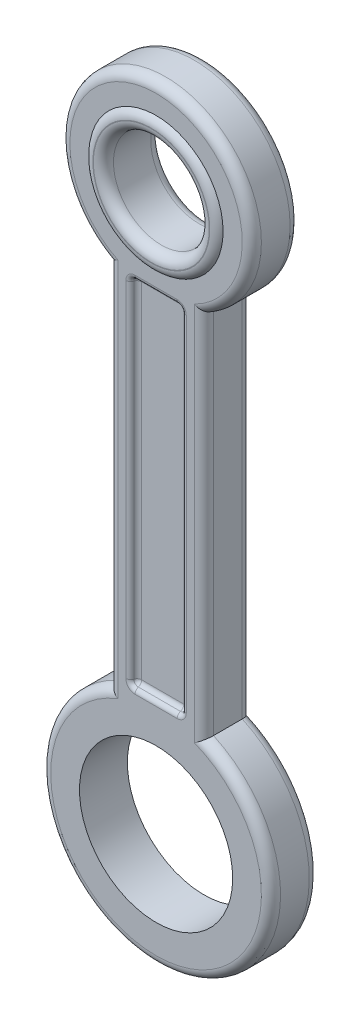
ISO-10303-21;
HEADER;
FILE_DESCRIPTION(('STEP AP214'),'2;1');
FILE_NAME('part.step','',(''),(''),'','','');
FILE_SCHEMA(('AUTOMOTIVE_DESIGN { 1 0 10303 214 1 1 1 1 }'));
ENDSEC;
DATA;
#1=APPLICATION_CONTEXT('core data for automotive mechanical design processes');
#2=APPLICATION_PROTOCOL_DEFINITION('international standard','automotive_design',2000,#1);
#3=PRODUCT_CONTEXT('',#1,'mechanical');
#4=PRODUCT('Part','Part','',(#3));
#5=PRODUCT_RELATED_PRODUCT_CATEGORY('part','',(#4));
#6=PRODUCT_DEFINITION_FORMATION('','',#4);
#7=PRODUCT_DEFINITION_CONTEXT('part definition',#1,'design');
#8=PRODUCT_DEFINITION('design','',#6,#7);
#9=PRODUCT_DEFINITION_SHAPE('','',#8);
#10=(LENGTH_UNIT() NAMED_UNIT(*) SI_UNIT(.MILLI.,.METRE.));
#11=(NAMED_UNIT(*) PLANE_ANGLE_UNIT() SI_UNIT($,.RADIAN.));
#12=(NAMED_UNIT(*) SI_UNIT($,.STERADIAN.) SOLID_ANGLE_UNIT());
#13=UNCERTAINTY_MEASURE_WITH_UNIT(LENGTH_MEASURE(1.E-05),#10,'distance_accuracy_value','');
#14=(GEOMETRIC_REPRESENTATION_CONTEXT(3) GLOBAL_UNCERTAINTY_ASSIGNED_CONTEXT((#13)) GLOBAL_UNIT_ASSIGNED_CONTEXT((#10,
#11,#12)) REPRESENTATION_CONTEXT('',''));
#15=CARTESIAN_POINT('',(0.,0.,0.));
#16=DIRECTION('',(0.,0.,1.));
#17=DIRECTION('',(1.,0.,0.));
#18=AXIS2_PLACEMENT_3D('',#15,#16,#17);
#19=CARTESIAN_POINT('',(0.,0.,2.5));
#20=DIRECTION('',(0.,0.,1.));
#21=DIRECTION('',(1.,0.,0.));
#22=AXIS2_PLACEMENT_3D('',#19,#20,#21);
#23=PLANE('',#22);
#24=CARTESIAN_POINT('',(2.19999999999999,-45.5,2.5));
#25=DIRECTION('',(0.,0.,1.));
#26=DIRECTION('',(1.,0.,0.));
#27=AXIS2_PLACEMENT_3D('',#24,#25,#26);
#28=CIRCLE('',#27,0.953939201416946);
#29=CARTESIAN_POINT('',(3.15393920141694,-45.5,2.5));
#30=VERTEX_POINT('',#29);
#31=CARTESIAN_POINT('',(2.19999999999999,-46.4539392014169,2.5));
#32=VERTEX_POINT('',#31);
#33=EDGE_CURVE('E653',#30,#32,#28,.F.);
#34=ORIENTED_EDGE('',*,*,#33,.T.);
#35=DIRECTION('',(-1.,0.,0.));
#36=VECTOR('',#35,1.);
#37=CARTESIAN_POINT('',(-2.2,-46.4539392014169,2.5));
#38=LINE('',#37,#36);
#39=CARTESIAN_POINT('',(-2.20000000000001,-46.4539392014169,2.5));
#40=VERTEX_POINT('',#39);
#41=EDGE_CURVE('E655',#32,#40,#38,.T.);
#42=ORIENTED_EDGE('',*,*,#41,.T.);
#43=CARTESIAN_POINT('',(-2.20000000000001,-45.5,2.5));
#44=DIRECTION('',(0.,0.,1.));
#45=DIRECTION('',(1.,0.,0.));
#46=AXIS2_PLACEMENT_3D('',#43,#44,#45);
#47=CIRCLE('',#46,0.953939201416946);
#48=CARTESIAN_POINT('',(-3.15393920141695,-45.5,2.5));
#49=VERTEX_POINT('',#48);
#50=EDGE_CURVE('E648',#40,#49,#47,.F.);
#51=ORIENTED_EDGE('',*,*,#50,.T.);
#52=DIRECTION('',(0.,1.,0.));
#53=VECTOR('',#52,1.);
#54=CARTESIAN_POINT('',(-3.15393920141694,-9.5,2.5));
#55=LINE('',#54,#53);
#56=CARTESIAN_POINT('',(-3.15393920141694,-9.5,2.5));
#57=VERTEX_POINT('',#56);
#58=EDGE_CURVE('E640',#49,#57,#55,.T.);
#59=ORIENTED_EDGE('',*,*,#58,.T.);
#60=CARTESIAN_POINT('',(-2.19999999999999,-9.5,2.5));
#61=DIRECTION('',(0.,0.,1.));
#62=DIRECTION('',(1.,0.,0.));
#63=AXIS2_PLACEMENT_3D('',#60,#61,#62);
#64=CIRCLE('',#63,0.953939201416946);
#65=CARTESIAN_POINT('',(-2.19999999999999,-8.54606079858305,2.5));
#66=VERTEX_POINT('',#65);
#67=EDGE_CURVE('E642',#57,#66,#64,.F.);
#68=ORIENTED_EDGE('',*,*,#67,.T.);
#69=DIRECTION('',(1.,0.,0.));
#70=VECTOR('',#69,1.);
#71=CARTESIAN_POINT('',(2.2,-8.54606079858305,2.5));
#72=LINE('',#71,#70);
#73=CARTESIAN_POINT('',(2.2,-8.54606079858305,2.5));
#74=VERTEX_POINT('',#73);
#75=EDGE_CURVE('E644',#66,#74,#72,.T.);
#76=ORIENTED_EDGE('',*,*,#75,.T.);
#77=CARTESIAN_POINT('',(2.2,-9.5,2.5));
#78=DIRECTION('',(0.,0.,1.));
#79=DIRECTION('',(1.,0.,0.));
#80=AXIS2_PLACEMENT_3D('',#77,#78,#79);
#81=CIRCLE('',#80,0.953939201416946);
#82=CARTESIAN_POINT('',(3.15393920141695,-9.5,2.5));
#83=VERTEX_POINT('',#82);
#84=EDGE_CURVE('E646',#74,#83,#81,.F.);
#85=ORIENTED_EDGE('',*,*,#84,.T.);
#86=DIRECTION('',(0.,-1.,0.));
#87=VECTOR('',#86,1.);
#88=CARTESIAN_POINT('',(3.15393920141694,-45.5,2.5));
#89=LINE('',#88,#87);
#90=EDGE_CURVE('E651',#83,#30,#89,.T.);
#91=ORIENTED_EDGE('',*,*,#90,.T.);
#92=EDGE_LOOP('',(#34,#42,#51,#59,#68,#76,#85,#91));
#93=FACE_BOUND('',#92,.T.);
#94=CARTESIAN_POINT('',(0.,0.,2.5));
#95=DIRECTION('',(0.,0.,1.));
#96=DIRECTION('',(1.,0.,0.));
#97=AXIS2_PLACEMENT_3D('',#94,#95,#96);
#98=CIRCLE('',#97,7.);
#99=CARTESIAN_POINT('',(7.,0.,2.5));
#100=VERTEX_POINT('',#99);
#101=EDGE_CURVE('E753',#100,#100,#98,.T.);
#102=ORIENTED_EDGE('',*,*,#101,.F.);
#103=EDGE_LOOP('',(#102));
#104=FACE_BOUND('',#103,.T.);
#105=CARTESIAN_POINT('',(0.,-58.,2.5));
#106=DIRECTION('',(0.,0.,1.));
#107=DIRECTION('',(1.,0.,0.));
#108=AXIS2_PLACEMENT_3D('',#105,#106,#107);
#109=CIRCLE('',#108,8.);
#110=CARTESIAN_POINT('',(8.00000000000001,-58.,2.5));
#111=VERTEX_POINT('',#110);
#112=EDGE_CURVE('E253',#111,#111,#109,.T.);
#113=ORIENTED_EDGE('',*,*,#112,.F.);
#114=EDGE_LOOP('',(#113));
#115=FACE_BOUND('',#114,.T.);
#116=CARTESIAN_POINT('',(0.,-58.,2.5));
#117=DIRECTION('',(0.,0.,1.));
#118=DIRECTION('',(1.,0.,0.));
#119=AXIS2_PLACEMENT_3D('',#116,#117,#118);
#120=CIRCLE('',#119,11.);
#121=CARTESIAN_POINT('',(-3.99999999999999,-47.7530492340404,2.5));
#122=VERTEX_POINT('',#121);
#123=CARTESIAN_POINT('',(4.00000000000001,-47.7530492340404,2.5));
#124=VERTEX_POINT('',#123);
#125=EDGE_CURVE('E721',#122,#124,#120,.T.);
#126=ORIENTED_EDGE('',*,*,#125,.T.);
#127=DIRECTION('',(0.,1.,0.));
#128=VECTOR('',#127,1.);
#129=CARTESIAN_POINT('',(4.00000000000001,-8.66025403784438,2.5));
#130=LINE('',#129,#128);
#131=CARTESIAN_POINT('',(4.00000000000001,-8.06225774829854,2.5));
#132=VERTEX_POINT('',#131);
#133=EDGE_CURVE('E534',#124,#132,#130,.T.);
#134=ORIENTED_EDGE('',*,*,#133,.T.);
#135=CARTESIAN_POINT('',(0.,0.,2.5));
#136=DIRECTION('',(0.,0.,1.));
#137=DIRECTION('',(1.,0.,0.));
#138=AXIS2_PLACEMENT_3D('',#135,#136,#137);
#139=CIRCLE('',#138,9.);
#140=CARTESIAN_POINT('',(-3.99999999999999,-8.06225774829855,2.5));
#141=VERTEX_POINT('',#140);
#142=EDGE_CURVE('E265',#132,#141,#139,.T.);
#143=ORIENTED_EDGE('',*,*,#142,.T.);
#144=DIRECTION('',(0.,-1.,0.));
#145=VECTOR('',#144,1.);
#146=CARTESIAN_POINT('',(-3.99999999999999,-47.0912878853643,2.5));
#147=LINE('',#146,#145);
#148=EDGE_CURVE('E532',#141,#122,#147,.T.);
#149=ORIENTED_EDGE('',*,*,#148,.T.);
#150=EDGE_LOOP('',(#126,#134,#143,#149));
#151=FACE_BOUND('',#150,.T.);
#152=ADVANCED_FACE('F37',(#93,#104,#115,#151),#23,.T.);
#153=CARTESIAN_POINT('',(0.,0.,-2.5));
#154=DIRECTION('',(0.,0.,1.));
#155=DIRECTION('',(1.,0.,0.));
#156=AXIS2_PLACEMENT_3D('',#153,#154,#155);
#157=PLANE('',#156);
#158=CARTESIAN_POINT('',(2.2,-9.5,-2.5));
#159=DIRECTION('',(0.,0.,1.));
#160=DIRECTION('',(1.,0.,0.));
#161=AXIS2_PLACEMENT_3D('',#158,#159,#160);
#162=CIRCLE('',#161,0.953939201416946);
#163=CARTESIAN_POINT('',(3.15393920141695,-9.5,-2.5));
#164=VERTEX_POINT('',#163);
#165=CARTESIAN_POINT('',(2.2,-8.54606079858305,-2.5));
#166=VERTEX_POINT('',#165);
#167=EDGE_CURVE('E618',#164,#166,#162,.T.);
#168=ORIENTED_EDGE('',*,*,#167,.T.);
#169=DIRECTION('',(1.,0.,0.));
#170=VECTOR('',#169,1.);
#171=CARTESIAN_POINT('',(0.,-8.54606079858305,-2.5));
#172=LINE('',#171,#170);
#173=CARTESIAN_POINT('',(-2.19999999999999,-8.54606079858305,-2.5));
#174=VERTEX_POINT('',#173);
#175=EDGE_CURVE('E625',#166,#174,#172,.F.);
#176=ORIENTED_EDGE('',*,*,#175,.T.);
#177=CARTESIAN_POINT('',(-2.19999999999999,-9.5,-2.5));
#178=DIRECTION('',(0.,0.,1.));
#179=DIRECTION('',(1.,0.,0.));
#180=AXIS2_PLACEMENT_3D('',#177,#178,#179);
#181=CIRCLE('',#180,0.953939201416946);
#182=CARTESIAN_POINT('',(-3.15393920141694,-9.5,-2.5));
#183=VERTEX_POINT('',#182);
#184=EDGE_CURVE('E623',#174,#183,#181,.T.);
#185=ORIENTED_EDGE('',*,*,#184,.T.);
#186=DIRECTION('',(0.,1.,0.));
#187=VECTOR('',#186,1.);
#188=CARTESIAN_POINT('',(-3.15393920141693,0.,-2.5));
#189=LINE('',#188,#187);
#190=CARTESIAN_POINT('',(-3.15393920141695,-45.5,-2.5));
#191=VERTEX_POINT('',#190);
#192=EDGE_CURVE('E621',#183,#191,#189,.F.);
#193=ORIENTED_EDGE('',*,*,#192,.T.);
#194=CARTESIAN_POINT('',(-2.20000000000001,-45.5,-2.5));
#195=DIRECTION('',(0.,0.,1.));
#196=DIRECTION('',(1.,0.,0.));
#197=AXIS2_PLACEMENT_3D('',#194,#195,#196);
#198=CIRCLE('',#197,0.953939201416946);
#199=CARTESIAN_POINT('',(-2.20000000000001,-46.4539392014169,-2.5));
#200=VERTEX_POINT('',#199);
#201=EDGE_CURVE('E616',#191,#200,#198,.T.);
#202=ORIENTED_EDGE('',*,*,#201,.T.);
#203=DIRECTION('',(-1.,0.,0.));
#204=VECTOR('',#203,1.);
#205=CARTESIAN_POINT('',(0.,-46.4539392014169,-2.5));
#206=LINE('',#205,#204);
#207=CARTESIAN_POINT('',(2.19999999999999,-46.4539392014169,-2.5));
#208=VERTEX_POINT('',#207);
#209=EDGE_CURVE('E614',#200,#208,#206,.F.);
#210=ORIENTED_EDGE('',*,*,#209,.T.);
#211=CARTESIAN_POINT('',(2.19999999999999,-45.5,-2.5));
#212=DIRECTION('',(0.,0.,1.));
#213=DIRECTION('',(1.,0.,0.));
#214=AXIS2_PLACEMENT_3D('',#211,#212,#213);
#215=CIRCLE('',#214,0.953939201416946);
#216=CARTESIAN_POINT('',(3.15393920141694,-45.5,-2.5));
#217=VERTEX_POINT('',#216);
#218=EDGE_CURVE('E612',#208,#217,#215,.T.);
#219=ORIENTED_EDGE('',*,*,#218,.T.);
#220=DIRECTION('',(0.,-1.,0.));
#221=VECTOR('',#220,1.);
#222=CARTESIAN_POINT('',(3.15393920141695,0.,-2.5));
#223=LINE('',#222,#221);
#224=EDGE_CURVE('E586',#217,#164,#223,.F.);
#225=ORIENTED_EDGE('',*,*,#224,.T.);
#226=EDGE_LOOP('',(#168,#176,#185,#193,#202,#210,#219,#225));
#227=FACE_BOUND('',#226,.T.);
#228=DIRECTION('',(0.,1.,0.));
#229=VECTOR('',#228,1.);
#230=CARTESIAN_POINT('',(4.00000000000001,0.,-2.5));
#231=LINE('',#230,#229);
#232=CARTESIAN_POINT('',(4.00000000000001,-8.06225774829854,-2.5));
#233=VERTEX_POINT('',#232);
#234=CARTESIAN_POINT('',(4.00000000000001,-47.7530492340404,-2.5));
#235=VERTEX_POINT('',#234);
#236=EDGE_CURVE('E58',#233,#235,#231,.F.);
#237=ORIENTED_EDGE('',*,*,#236,.T.);
#238=CARTESIAN_POINT('',(0.,-58.,-2.5));
#239=DIRECTION('',(0.,0.,1.));
#240=DIRECTION('',(1.,0.,0.));
#241=AXIS2_PLACEMENT_3D('',#238,#239,#240);
#242=CIRCLE('',#241,11.);
#243=CARTESIAN_POINT('',(-3.99999999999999,-47.7530492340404,-2.5));
#244=VERTEX_POINT('',#243);
#245=EDGE_CURVE('E731',#235,#244,#242,.F.);
#246=ORIENTED_EDGE('',*,*,#245,.T.);
#247=DIRECTION('',(0.,-1.,0.));
#248=VECTOR('',#247,1.);
#249=CARTESIAN_POINT('',(-3.99999999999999,0.,-2.5));
#250=LINE('',#249,#248);
#251=CARTESIAN_POINT('',(-3.99999999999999,-8.06225774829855,-2.5));
#252=VERTEX_POINT('',#251);
#253=EDGE_CURVE('E66',#244,#252,#250,.F.);
#254=ORIENTED_EDGE('',*,*,#253,.T.);
#255=CARTESIAN_POINT('',(0.,0.,-2.5));
#256=DIRECTION('',(0.,0.,1.));
#257=DIRECTION('',(1.,0.,0.));
#258=AXIS2_PLACEMENT_3D('',#255,#256,#257);
#259=CIRCLE('',#258,9.);
#260=EDGE_CURVE('E729',#252,#233,#259,.F.);
#261=ORIENTED_EDGE('',*,*,#260,.T.);
#262=EDGE_LOOP('',(#237,#246,#254,#261));
#263=FACE_BOUND('',#262,.T.);
#264=CARTESIAN_POINT('',(0.,-58.,-2.5));
#265=DIRECTION('',(0.,0.,1.));
#266=DIRECTION('',(1.,0.,0.));
#267=AXIS2_PLACEMENT_3D('',#264,#265,#266);
#268=CIRCLE('',#267,8.);
#269=CARTESIAN_POINT('',(8.00000000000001,-58.,-2.5));
#270=VERTEX_POINT('',#269);
#271=EDGE_CURVE('E594',#270,#270,#268,.F.);
#272=ORIENTED_EDGE('',*,*,#271,.F.);
#273=EDGE_LOOP('',(#272));
#274=FACE_BOUND('',#273,.T.);
#275=CARTESIAN_POINT('',(0.,0.,-2.5));
#276=DIRECTION('',(0.,0.,1.));
#277=DIRECTION('',(1.,0.,0.));
#278=AXIS2_PLACEMENT_3D('',#275,#276,#277);
#279=CIRCLE('',#278,7.);
#280=CARTESIAN_POINT('',(7.,0.,-2.5));
#281=VERTEX_POINT('',#280);
#282=EDGE_CURVE('E738',#281,#281,#279,.F.);
#283=ORIENTED_EDGE('',*,*,#282,.F.);
#284=EDGE_LOOP('',(#283));
#285=FACE_BOUND('',#284,.T.);
#286=ADVANCED_FACE('F470',(#227,#263,#274,#285),#157,.F.);
#287=CARTESIAN_POINT('',(0.,0.,2.5));
#288=DIRECTION('',(0.,0.,-1.));
#289=DIRECTION('',(-1.,0.,0.));
#290=AXIS2_PLACEMENT_3D('',#287,#288,#289);
#291=CYLINDRICAL_SURFACE('',#290,10.);
#292=DIRECTION('',(0.,0.,-1.));
#293=VECTOR('',#292,1.);
#294=CARTESIAN_POINT('',(-4.99999999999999,-8.66025403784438,2.5));
#295=LINE('',#294,#293);
#296=CARTESIAN_POINT('',(-4.99999999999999,-8.66025403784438,1.5));
#297=VERTEX_POINT('',#296);
#298=CARTESIAN_POINT('',(-4.99999999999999,-8.66025403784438,-1.5));
#299=VERTEX_POINT('',#298);
#300=EDGE_CURVE('E235',#297,#299,#295,.T.);
#301=ORIENTED_EDGE('',*,*,#300,.F.);
#302=CARTESIAN_POINT('',(0.,0.,1.5));
#303=DIRECTION('',(0.,0.,1.));
#304=DIRECTION('',(1.,0.,0.));
#305=AXIS2_PLACEMENT_3D('',#302,#303,#304);
#306=CIRCLE('',#305,10.);
#307=CARTESIAN_POINT('',(5.00000000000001,-8.66025403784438,1.5));
#308=VERTEX_POINT('',#307);
#309=EDGE_CURVE('E228',#297,#308,#306,.F.);
#310=ORIENTED_EDGE('',*,*,#309,.T.);
#311=DIRECTION('',(0.,0.,-1.));
#312=VECTOR('',#311,1.);
#313=CARTESIAN_POINT('',(5.00000000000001,-8.66025403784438,2.5));
#314=LINE('',#313,#312);
#315=CARTESIAN_POINT('',(5.00000000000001,-8.66025403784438,-1.5));
#316=VERTEX_POINT('',#315);
#317=EDGE_CURVE('E232',#308,#316,#314,.T.);
#318=ORIENTED_EDGE('',*,*,#317,.T.);
#319=CARTESIAN_POINT('',(0.,0.,-1.5));
#320=DIRECTION('',(0.,0.,1.));
#321=DIRECTION('',(1.,0.,0.));
#322=AXIS2_PLACEMENT_3D('',#319,#320,#321);
#323=CIRCLE('',#322,10.);
#324=EDGE_CURVE('E240',#316,#299,#323,.T.);
#325=ORIENTED_EDGE('',*,*,#324,.T.);
#326=EDGE_LOOP('',(#301,#310,#318,#325));
#327=FACE_BOUND('',#326,.T.);
#328=ADVANCED_FACE('F230',(#327),#291,.T.);
#329=CARTESIAN_POINT('',(-4.99999999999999,-8.66025403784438,2.5));
#330=DIRECTION('',(1.,0.,0.));
#331=DIRECTION('',(0.,1.,0.));
#332=AXIS2_PLACEMENT_3D('',#329,#330,#331);
#333=PLANE('',#332);
#334=DIRECTION('',(0.,0.,-1.));
#335=VECTOR('',#334,1.);
#336=CARTESIAN_POINT('',(-4.99999999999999,-47.0912878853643,2.5));
#337=LINE('',#336,#335);
#338=CARTESIAN_POINT('',(-4.99999999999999,-47.0912878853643,1.5));
#339=VERTEX_POINT('',#338);
#340=CARTESIAN_POINT('',(-4.99999999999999,-47.0912878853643,-1.5));
#341=VERTEX_POINT('',#340);
#342=EDGE_CURVE('E739',#339,#341,#337,.T.);
#343=ORIENTED_EDGE('',*,*,#342,.F.);
#344=DIRECTION('',(0.,-1.,0.));
#345=VECTOR('',#344,1.);
#346=CARTESIAN_POINT('',(-4.99999999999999,-8.66025403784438,1.5));
#347=LINE('',#346,#345);
#348=EDGE_CURVE('E539',#339,#297,#347,.F.);
#349=ORIENTED_EDGE('',*,*,#348,.T.);
#350=ORIENTED_EDGE('',*,*,#300,.T.);
#351=DIRECTION('',(0.,-1.,0.));
#352=VECTOR('',#351,1.);
#353=CARTESIAN_POINT('',(-4.99999999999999,-8.66025403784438,-1.5));
#354=LINE('',#353,#352);
#355=EDGE_CURVE('E261',#299,#341,#354,.T.);
#356=ORIENTED_EDGE('',*,*,#355,.T.);
#357=EDGE_LOOP('',(#343,#349,#350,#356));
#358=FACE_BOUND('',#357,.T.);
#359=ADVANCED_FACE('F488',(#358),#333,.F.);
#360=CARTESIAN_POINT('',(0.,-58.,2.5));
#361=DIRECTION('',(0.,0.,-1.));
#362=DIRECTION('',(-1.,0.,0.));
#363=AXIS2_PLACEMENT_3D('',#360,#361,#362);
#364=CYLINDRICAL_SURFACE('',#363,12.);
#365=DIRECTION('',(0.,0.,-1.));
#366=VECTOR('',#365,1.);
#367=CARTESIAN_POINT('',(5.00000000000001,-47.0912878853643,2.5));
#368=LINE('',#367,#366);
#369=CARTESIAN_POINT('',(5.00000000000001,-47.0912878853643,1.5));
#370=VERTEX_POINT('',#369);
#371=CARTESIAN_POINT('',(5.00000000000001,-47.0912878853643,-1.5));
#372=VERTEX_POINT('',#371);
#373=EDGE_CURVE('E252',#370,#372,#368,.T.);
#374=ORIENTED_EDGE('',*,*,#373,.F.);
#375=CARTESIAN_POINT('',(0.,-58.,1.5));
#376=DIRECTION('',(0.,0.,1.));
#377=DIRECTION('',(1.,0.,0.));
#378=AXIS2_PLACEMENT_3D('',#375,#376,#377);
#379=CIRCLE('',#378,12.);
#380=EDGE_CURVE('E727',#370,#339,#379,.F.);
#381=ORIENTED_EDGE('',*,*,#380,.T.);
#382=ORIENTED_EDGE('',*,*,#342,.T.);
#383=CARTESIAN_POINT('',(0.,-58.,-1.5));
#384=DIRECTION('',(0.,0.,1.));
#385=DIRECTION('',(1.,0.,0.));
#386=AXIS2_PLACEMENT_3D('',#383,#384,#385);
#387=CIRCLE('',#386,12.);
#388=EDGE_CURVE('E724',#341,#372,#387,.T.);
#389=ORIENTED_EDGE('',*,*,#388,.T.);
#390=EDGE_LOOP('',(#374,#381,#382,#389));
#391=FACE_BOUND('',#390,.T.);
#392=ADVANCED_FACE('F485',(#391),#364,.T.);
#393=CARTESIAN_POINT('',(5.00000000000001,-8.66025403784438,2.5));
#394=DIRECTION('',(-1.,0.,0.));
#395=DIRECTION('',(0.,-1.,0.));
#396=AXIS2_PLACEMENT_3D('',#393,#394,#395);
#397=PLANE('',#396);
#398=ORIENTED_EDGE('',*,*,#317,.F.);
#399=DIRECTION('',(0.,1.,0.));
#400=VECTOR('',#399,1.);
#401=CARTESIAN_POINT('',(5.00000000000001,-47.0912878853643,1.5));
#402=LINE('',#401,#400);
#403=EDGE_CURVE('E248',#308,#370,#402,.F.);
#404=ORIENTED_EDGE('',*,*,#403,.T.);
#405=ORIENTED_EDGE('',*,*,#373,.T.);
#406=DIRECTION('',(0.,1.,0.));
#407=VECTOR('',#406,1.);
#408=CARTESIAN_POINT('',(5.00000000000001,-8.66025403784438,-1.5));
#409=LINE('',#408,#407);
#410=EDGE_CURVE('E251',#372,#316,#409,.T.);
#411=ORIENTED_EDGE('',*,*,#410,.T.);
#412=EDGE_LOOP('',(#398,#404,#405,#411));
#413=FACE_BOUND('',#412,.T.);
#414=ADVANCED_FACE('F246',(#413),#397,.F.);
#415=CARTESIAN_POINT('',(0.,-58.,2.501));
#416=DIRECTION('',(0.,0.,-1.));
#417=DIRECTION('',(-1.,0.,0.));
#418=AXIS2_PLACEMENT_3D('',#415,#416,#417);
#419=CYLINDRICAL_SURFACE('',#418,8.);
#420=ORIENTED_EDGE('',*,*,#112,.T.);
#421=EDGE_LOOP('',(#420));
#422=FACE_BOUND('',#421,.T.);
#423=ORIENTED_EDGE('',*,*,#271,.T.);
#424=EDGE_LOOP('',(#423));
#425=FACE_BOUND('',#424,.T.);
#426=ADVANCED_FACE('F480',(#422,#425),#419,.F.);
#427=CARTESIAN_POINT('',(0.,0.,2.501));
#428=DIRECTION('',(0.,0.,-1.));
#429=DIRECTION('',(-1.,0.,0.));
#430=AXIS2_PLACEMENT_3D('',#427,#428,#429);
#431=CYLINDRICAL_SURFACE('',#430,5.);
#432=CARTESIAN_POINT('',(0.,0.,1.95));
#433=DIRECTION('',(0.,0.,1.));
#434=DIRECTION('',(1.,0.,0.));
#435=AXIS2_PLACEMENT_3D('',#432,#433,#434);
#436=CIRCLE('',#435,5.);
#437=CARTESIAN_POINT('',(5.,0.,1.95));
#438=VERTEX_POINT('',#437);
#439=EDGE_CURVE('E518',#438,#438,#436,.T.);
#440=ORIENTED_EDGE('',*,*,#439,.T.);
#441=EDGE_LOOP('',(#440));
#442=FACE_BOUND('',#441,.T.);
#443=CARTESIAN_POINT('',(0.,0.,-1.95));
#444=DIRECTION('',(0.,0.,-1.));
#445=DIRECTION('',(-1.,0.,0.));
#446=AXIS2_PLACEMENT_3D('',#443,#444,#445);
#447=CIRCLE('',#446,5.);
#448=CARTESIAN_POINT('',(-5.,0.,-1.95));
#449=VERTEX_POINT('',#448);
#450=EDGE_CURVE('E516',#449,#449,#447,.T.);
#451=ORIENTED_EDGE('',*,*,#450,.T.);
#452=EDGE_LOOP('',(#451));
#453=FACE_BOUND('',#452,.T.);
#454=ADVANCED_FACE('F1115',(#442,#453),#431,.F.);
#455=CARTESIAN_POINT('',(0.,0.,-3.));
#456=DIRECTION('',(0.,0.,-1.));
#457=DIRECTION('',(-1.,0.,0.));
#458=AXIS2_PLACEMENT_3D('',#455,#456,#457);
#459=PLANE('',#458);
#460=CARTESIAN_POINT('',(0.,0.,-3.));
#461=DIRECTION('',(0.,0.,-1.));
#462=DIRECTION('',(-1.,0.,0.));
#463=AXIS2_PLACEMENT_3D('',#460,#461,#462);
#464=CIRCLE('',#463,6.05);
#465=CARTESIAN_POINT('',(-6.05,0.,-3.));
#466=VERTEX_POINT('',#465);
#467=EDGE_CURVE('E513',#466,#466,#464,.F.);
#468=ORIENTED_EDGE('',*,*,#467,.T.);
#469=EDGE_LOOP('',(#468));
#470=FACE_BOUND('',#469,.T.);
#471=CARTESIAN_POINT('',(0.,0.,-3.));
#472=DIRECTION('',(0.,0.,-1.));
#473=DIRECTION('',(-1.,0.,0.));
#474=AXIS2_PLACEMENT_3D('',#471,#472,#473);
#475=CIRCLE('',#474,6.10557280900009);
#476=CARTESIAN_POINT('',(-6.10557280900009,0.,-3.));
#477=VERTEX_POINT('',#476);
#478=EDGE_CURVE('E522',#477,#477,#475,.T.);
#479=ORIENTED_EDGE('',*,*,#478,.T.);
#480=EDGE_LOOP('',(#479));
#481=FACE_BOUND('',#480,.T.);
#482=ADVANCED_FACE('F1095',(#470,#481),#459,.T.);
#483=CARTESIAN_POINT('',(0.,0.,-1.8));
#484=DIRECTION('',(0.,0.,-1.));
#485=DIRECTION('',(-1.,0.,0.));
#486=AXIS2_PLACEMENT_3D('',#483,#484,#485);
#487=PLANE('',#486);
#488=DIRECTION('',(0.,1.,0.));
#489=VECTOR('',#488,1.);
#490=CARTESIAN_POINT('',(-2.19999999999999,0.,-1.8));
#491=LINE('',#490,#489);
#492=CARTESIAN_POINT('',(-2.20000000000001,-45.5,-1.8));
#493=VERTEX_POINT('',#492);
#494=CARTESIAN_POINT('',(-2.19999999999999,-9.5,-1.8));
#495=VERTEX_POINT('',#494);
#496=EDGE_CURVE('E553',#493,#495,#491,.T.);
#497=ORIENTED_EDGE('',*,*,#496,.T.);
#498=DIRECTION('',(1.,0.,0.));
#499=VECTOR('',#498,1.);
#500=CARTESIAN_POINT('',(0.,-9.5,-1.8));
#501=LINE('',#500,#499);
#502=CARTESIAN_POINT('',(2.2,-9.5,-1.8));
#503=VERTEX_POINT('',#502);
#504=EDGE_CURVE('E583',#495,#503,#501,.T.);
#505=ORIENTED_EDGE('',*,*,#504,.T.);
#506=DIRECTION('',(0.,-1.,0.));
#507=VECTOR('',#506,1.);
#508=CARTESIAN_POINT('',(2.20000000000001,0.,-1.8));
#509=LINE('',#508,#507);
#510=CARTESIAN_POINT('',(2.19999999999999,-45.5,-1.8));
#511=VERTEX_POINT('',#510);
#512=EDGE_CURVE('E550',#503,#511,#509,.T.);
#513=ORIENTED_EDGE('',*,*,#512,.T.);
#514=DIRECTION('',(-1.,0.,0.));
#515=VECTOR('',#514,1.);
#516=CARTESIAN_POINT('',(0.,-45.5,-1.8));
#517=LINE('',#516,#515);
#518=EDGE_CURVE('E580',#511,#493,#517,.T.);
#519=ORIENTED_EDGE('',*,*,#518,.T.);
#520=EDGE_LOOP('',(#497,#505,#513,#519));
#521=FACE_BOUND('',#520,.T.);
#522=ADVANCED_FACE('F1091',(#521),#487,.T.);
#523=CARTESIAN_POINT('',(0.,0.,3.));
#524=DIRECTION('',(0.,0.,1.));
#525=DIRECTION('',(-1.,0.,0.));
#526=AXIS2_PLACEMENT_3D('',#523,#524,#525);
#527=PLANE('',#526);
#528=CARTESIAN_POINT('',(0.,0.,3.));
#529=DIRECTION('',(0.,0.,1.));
#530=DIRECTION('',(1.,0.,0.));
#531=AXIS2_PLACEMENT_3D('',#528,#529,#530);
#532=CIRCLE('',#531,6.05);
#533=CARTESIAN_POINT('',(6.05,0.,3.));
#534=VERTEX_POINT('',#533);
#535=EDGE_CURVE('E519',#534,#534,#532,.F.);
#536=ORIENTED_EDGE('',*,*,#535,.T.);
#537=EDGE_LOOP('',(#536));
#538=FACE_BOUND('',#537,.T.);
#539=CARTESIAN_POINT('',(0.,0.,3.));
#540=DIRECTION('',(0.,0.,1.));
#541=DIRECTION('',(1.,0.,0.));
#542=AXIS2_PLACEMENT_3D('',#539,#540,#541);
#543=CIRCLE('',#542,6.10557280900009);
#544=CARTESIAN_POINT('',(6.10557280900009,0.,3.));
#545=VERTEX_POINT('',#544);
#546=EDGE_CURVE('E525',#545,#545,#543,.T.);
#547=ORIENTED_EDGE('',*,*,#546,.T.);
#548=EDGE_LOOP('',(#547));
#549=FACE_BOUND('',#548,.T.);
#550=ADVANCED_FACE('F761',(#538,#549),#527,.T.);
#551=CARTESIAN_POINT('',(0.,0.,1.8));
#552=DIRECTION('',(0.,0.,1.));
#553=DIRECTION('',(-1.,0.,0.));
#554=AXIS2_PLACEMENT_3D('',#551,#552,#553);
#555=PLANE('',#554);
#556=DIRECTION('',(0.,1.,0.));
#557=VECTOR('',#556,1.);
#558=CARTESIAN_POINT('',(-2.20000000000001,-46.,1.8));
#559=LINE('',#558,#557);
#560=CARTESIAN_POINT('',(-2.19999999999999,-9.49999999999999,1.8));
#561=VERTEX_POINT('',#560);
#562=CARTESIAN_POINT('',(-2.20000000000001,-45.5,1.8));
#563=VERTEX_POINT('',#562);
#564=EDGE_CURVE('E544',#561,#563,#559,.F.);
#565=ORIENTED_EDGE('',*,*,#564,.T.);
#566=DIRECTION('',(-1.,0.,0.));
#567=VECTOR('',#566,1.);
#568=CARTESIAN_POINT('',(2.19999999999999,-45.5,1.8));
#569=LINE('',#568,#567);
#570=CARTESIAN_POINT('',(2.19999999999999,-45.5,1.8));
#571=VERTEX_POINT('',#570);
#572=EDGE_CURVE('E578',#563,#571,#569,.F.);
#573=ORIENTED_EDGE('',*,*,#572,.T.);
#574=DIRECTION('',(0.,-1.,0.));
#575=VECTOR('',#574,1.);
#576=CARTESIAN_POINT('',(2.2,-9.,1.8));
#577=LINE('',#576,#575);
#578=CARTESIAN_POINT('',(2.2,-9.5,1.8));
#579=VERTEX_POINT('',#578);
#580=EDGE_CURVE('E547',#571,#579,#577,.F.);
#581=ORIENTED_EDGE('',*,*,#580,.T.);
#582=DIRECTION('',(1.,0.,0.));
#583=VECTOR('',#582,1.);
#584=CARTESIAN_POINT('',(-2.19999999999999,-9.5,1.8));
#585=LINE('',#584,#583);
#586=EDGE_CURVE('E576',#579,#561,#585,.F.);
#587=ORIENTED_EDGE('',*,*,#586,.T.);
#588=EDGE_LOOP('',(#565,#573,#581,#587));
#589=FACE_BOUND('',#588,.T.);
#590=ADVANCED_FACE('F499',(#589),#555,.T.);
#591=CARTESIAN_POINT('',(0.,0.,1.95));
#592=DIRECTION('',(0.,0.,1.));
#593=DIRECTION('',(1.,0.,0.));
#594=AXIS2_PLACEMENT_3D('',#591,#592,#593);
#595=TOROIDAL_SURFACE('',#594,6.05,1.05);
#596=ORIENTED_EDGE('',*,*,#439,.F.);
#597=EDGE_LOOP('',(#596));
#598=FACE_BOUND('',#597,.T.);
#599=ORIENTED_EDGE('',*,*,#535,.F.);
#600=EDGE_LOOP('',(#599));
#601=FACE_BOUND('',#600,.T.);
#602=ADVANCED_FACE('F495',(#598,#601),#595,.T.);
#603=CARTESIAN_POINT('',(0.,0.,1.95));
#604=DIRECTION('',(0.,0.,-1.));
#605=DIRECTION('',(-1.,0.,0.));
#606=AXIS2_PLACEMENT_3D('',#603,#604,#605);
#607=TOROIDAL_SURFACE('',#606,6.10557280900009,1.05);
#608=ORIENTED_EDGE('',*,*,#546,.F.);
#609=EDGE_LOOP('',(#608));
#610=FACE_BOUND('',#609,.T.);
#611=ORIENTED_EDGE('',*,*,#101,.T.);
#612=EDGE_LOOP('',(#611));
#613=FACE_BOUND('',#612,.T.);
#614=ADVANCED_FACE('F498',(#610,#613),#607,.T.);
#615=CARTESIAN_POINT('',(0.,0.,-1.95));
#616=DIRECTION('',(0.,0.,-1.));
#617=DIRECTION('',(-1.,0.,0.));
#618=AXIS2_PLACEMENT_3D('',#615,#616,#617);
#619=TOROIDAL_SURFACE('',#618,6.05,1.05);
#620=ORIENTED_EDGE('',*,*,#467,.F.);
#621=EDGE_LOOP('',(#620));
#622=FACE_BOUND('',#621,.T.);
#623=ORIENTED_EDGE('',*,*,#450,.F.);
#624=EDGE_LOOP('',(#623));
#625=FACE_BOUND('',#624,.T.);
#626=ADVANCED_FACE('F502',(#622,#625),#619,.T.);
#627=CARTESIAN_POINT('',(0.,0.,-1.95));
#628=DIRECTION('',(0.,0.,1.));
#629=DIRECTION('',(1.,0.,0.));
#630=AXIS2_PLACEMENT_3D('',#627,#628,#629);
#631=TOROIDAL_SURFACE('',#630,6.10557280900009,1.05);
#632=ORIENTED_EDGE('',*,*,#282,.T.);
#633=EDGE_LOOP('',(#632));
#634=FACE_BOUND('',#633,.T.);
#635=ORIENTED_EDGE('',*,*,#478,.F.);
#636=EDGE_LOOP('',(#635));
#637=FACE_BOUND('',#636,.T.);
#638=ADVANCED_FACE('F292',(#634,#637),#631,.T.);
#639=CARTESIAN_POINT('',(4.00000000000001,0.,1.5));
#640=DIRECTION('',(0.,-1.,0.));
#641=DIRECTION('',(1.,0.,0.));
#642=AXIS2_PLACEMENT_3D('',#639,#640,#641);
#643=CYLINDRICAL_SURFACE('',#642,1.);
#644=ORIENTED_EDGE('',*,*,#133,.F.);
#645=CARTESIAN_POINT('',(5.00000000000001,-47.0912878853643,1.5));
#646=CARTESIAN_POINT('',(5.00000176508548,-47.0912869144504,1.52492275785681));
#647=CARTESIAN_POINT('',(4.99906754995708,-47.0918862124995,1.54983225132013));
#648=CARTESIAN_POINT('',(4.99535359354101,-47.0942697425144,1.5994470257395));
#649=CARTESIAN_POINT('',(4.99257454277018,-47.0960535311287,1.62415237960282));
#650=CARTESIAN_POINT('',(4.98155002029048,-47.1031323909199,1.69744920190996));
#651=CARTESIAN_POINT('',(4.9706165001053,-47.110155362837,1.74550428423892));
#652=CARTESIAN_POINT('',(4.94216965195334,-47.1284565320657,1.83866104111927));
#653=CARTESIAN_POINT('',(4.92466324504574,-47.139730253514,1.88376576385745));
#654=CARTESIAN_POINT('',(4.88388621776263,-47.1660450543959,1.97013636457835));
#655=CARTESIAN_POINT('',(4.8606100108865,-47.1810897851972,2.01139846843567));
#656=CARTESIAN_POINT('',(4.80776137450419,-47.2153364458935,2.09157213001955));
#657=CARTESIAN_POINT('',(4.77790522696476,-47.234726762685,2.13021475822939));
#658=CARTESIAN_POINT('',(4.71388477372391,-47.276436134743,2.20191233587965));
#659=CARTESIAN_POINT('',(4.67971958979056,-47.29875578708,2.23496614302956));
#660=CARTESIAN_POINT('',(4.60269043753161,-47.3492538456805,2.29978903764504));
#661=CARTESIAN_POINT('',(4.55928983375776,-47.3778091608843,2.33062559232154));
#662=CARTESIAN_POINT('',(4.46934641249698,-47.4372477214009,2.38457337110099));
#663=CARTESIAN_POINT('',(4.42279950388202,-47.4681340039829,2.40767429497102));
#664=CARTESIAN_POINT('',(4.31552780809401,-47.5396477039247,2.45110082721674));
#665=CARTESIAN_POINT('',(4.25421917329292,-47.5807477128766,2.46920929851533));
#666=CARTESIAN_POINT('',(4.13034022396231,-47.6643091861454,2.49347103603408));
#667=CARTESIAN_POINT('',(4.06777263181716,-47.7067678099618,2.49964777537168));
#668=CARTESIAN_POINT('',(4.00360724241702,-47.7505852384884,2.49999512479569));
#669=CARTESIAN_POINT('',(4.00180352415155,-47.7518171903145,2.50000000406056));
#670=CARTESIAN_POINT('',(4.00000000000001,-47.7530492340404,2.5));
#671=B_SPLINE_CURVE_WITH_KNOTS('',3,(#645,#646,#647,#648,#649,#650,#651,#652,#653,#654,#655,
#656,#657,#658,#659,#660,#661,#662,#663,#664,#665,#666,#667,#668,#669,#670),.UNSPECIFIED.,.F.,
.F.,(4,2,2,2,2,2,2,2,2,2,2,2,4),(0.,0.0747178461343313,0.149407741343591,0.297950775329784,
0.446337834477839,0.594869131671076,0.751885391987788,0.908933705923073,1.0894847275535,
1.27027521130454,1.49725778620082,1.72379336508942,1.73034621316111),.UNSPECIFIED.);
#672=EDGE_CURVE('E239',#124,#370,#671,.F.);
#673=ORIENTED_EDGE('',*,*,#672,.T.);
#674=ORIENTED_EDGE('',*,*,#403,.F.);
#675=CARTESIAN_POINT('',(5.00000000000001,-8.66025403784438,1.5));
#676=CARTESIAN_POINT('',(5.00000151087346,-8.66025473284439,1.52539977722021));
#677=CARTESIAN_POINT('',(4.99903153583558,-8.659694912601,1.55078631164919));
#678=CARTESIAN_POINT('',(4.99517322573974,-8.65746695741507,1.60135628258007));
#679=CARTESIAN_POINT('',(4.99228549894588,-8.65579917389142,1.62653978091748));
#680=CARTESIAN_POINT('',(4.98081993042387,-8.64917451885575,1.70129561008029));
#681=CARTESIAN_POINT('',(4.96943913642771,-8.64259604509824,1.75033009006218));
#682=CARTESIAN_POINT('',(4.93976927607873,-8.62541392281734,1.84542424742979));
#683=CARTESIAN_POINT('',(4.92148570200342,-8.6148134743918,1.89148625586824));
#684=CARTESIAN_POINT('',(4.87881638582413,-8.59001264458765,1.97966952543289));
#685=CARTESIAN_POINT('',(4.8544258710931,-8.57580944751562,2.02178766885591));
#686=CARTESIAN_POINT('',(4.79915119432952,-8.54352295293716,2.10324061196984));
#687=CARTESIAN_POINT('',(4.76800529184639,-8.52528235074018,2.14233432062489));
#688=CARTESIAN_POINT('',(4.70113639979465,-8.48597374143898,2.21472967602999));
#689=CARTESIAN_POINT('',(4.66541231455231,-8.4649050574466,2.24802993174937));
#690=CARTESIAN_POINT('',(4.58566418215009,-8.41767583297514,2.31236893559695));
#691=CARTESIAN_POINT('',(4.54116187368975,-8.39120832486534,2.34258846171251));
#692=CARTESIAN_POINT('',(4.44893900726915,-8.33607530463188,2.39514001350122));
#693=CARTESIAN_POINT('',(4.40121494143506,-8.30740739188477,2.41746327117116));
#694=CARTESIAN_POINT('',(4.29631545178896,-8.24404654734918,2.45697379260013));
#695=CARTESIAN_POINT('',(4.23880605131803,-8.20910016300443,2.47286459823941));
#696=CARTESIAN_POINT('',(4.12269620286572,-8.13807222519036,2.49419313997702));
#697=CARTESIAN_POINT('',(4.06409818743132,-8.10199310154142,2.49965187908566));
#698=CARTESIAN_POINT('',(4.00378591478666,-8.0646054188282,2.4999946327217));
#699=CARTESIAN_POINT('',(4.00189285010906,-8.06343164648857,2.5000000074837));
#700=CARTESIAN_POINT('',(4.00000000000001,-8.06225774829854,2.5));
#701=B_SPLINE_CURVE_WITH_KNOTS('',3,(#675,#676,#677,#678,#679,#680,#681,#682,#683,#684,#685,
#686,#687,#688,#689,#690,#691,#692,#693,#694,#695,#696,#697,#698,#699,#700),.UNSPECIFIED.,.F.,
.F.,(4,2,2,2,2,2,2,2,2,2,2,2,4),(0.,0.076148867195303,0.152273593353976,0.30376313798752,
0.455132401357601,0.606620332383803,0.765609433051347,0.924636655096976,1.10378472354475,
1.28313109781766,1.48973857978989,1.69592965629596,1.70261192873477),.UNSPECIFIED.);
#702=EDGE_CURVE('E258',#308,#132,#701,.T.);
#703=ORIENTED_EDGE('',*,*,#702,.T.);
#704=EDGE_LOOP('',(#644,#673,#674,#703));
#705=FACE_BOUND('',#704,.T.);
#706=ADVANCED_FACE('F257',(#705),#643,.T.);
#707=CARTESIAN_POINT('',(-3.99999999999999,0.,1.5));
#708=DIRECTION('',(0.,1.,0.));
#709=DIRECTION('',(-1.,0.,0.));
#710=AXIS2_PLACEMENT_3D('',#707,#708,#709);
#711=CYLINDRICAL_SURFACE('',#710,1.);
#712=ORIENTED_EDGE('',*,*,#148,.F.);
#713=CARTESIAN_POINT('',(-5.,-8.66025403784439,1.5));
#714=CARTESIAN_POINT('',(-5.00000151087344,-8.6602547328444,1.52539977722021));
#715=CARTESIAN_POINT('',(-4.99903153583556,-8.65969491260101,1.55078631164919));
#716=CARTESIAN_POINT('',(-4.99517322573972,-8.65746695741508,1.60135628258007));
#717=CARTESIAN_POINT('',(-4.99228549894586,-8.65579917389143,1.62653978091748));
#718=CARTESIAN_POINT('',(-4.98081993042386,-8.64917451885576,1.70129561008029));
#719=CARTESIAN_POINT('',(-4.96943913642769,-8.64259604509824,1.75033009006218));
#720=CARTESIAN_POINT('',(-4.93976927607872,-8.62541392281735,1.84542424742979));
#721=CARTESIAN_POINT('',(-4.92148570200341,-8.61481347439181,1.89148625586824));
#722=CARTESIAN_POINT('',(-4.87881638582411,-8.59001264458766,1.97966952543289));
#723=CARTESIAN_POINT('',(-4.85442587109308,-8.57580944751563,2.02178766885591));
#724=CARTESIAN_POINT('',(-4.7991511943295,-8.54352295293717,2.10324061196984));
#725=CARTESIAN_POINT('',(-4.76800529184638,-8.52528235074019,2.14233432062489));
#726=CARTESIAN_POINT('',(-4.70113639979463,-8.48597374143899,2.21472967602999));
#727=CARTESIAN_POINT('',(-4.66541231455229,-8.4649050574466,2.24802993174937));
#728=CARTESIAN_POINT('',(-4.58566418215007,-8.41767583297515,2.31236893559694));
#729=CARTESIAN_POINT('',(-4.54116187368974,-8.39120832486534,2.34258846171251));
#730=CARTESIAN_POINT('',(-4.44893900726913,-8.33607530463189,2.39514001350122));
#731=CARTESIAN_POINT('',(-4.40121494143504,-8.30740739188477,2.41746327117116));
#732=CARTESIAN_POINT('',(-4.29631545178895,-8.24404654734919,2.45697379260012));
#733=CARTESIAN_POINT('',(-4.238806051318,-8.20910016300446,2.47286459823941));
#734=CARTESIAN_POINT('',(-4.12269620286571,-8.13807222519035,2.49419313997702));
#735=CARTESIAN_POINT('',(-4.06409818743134,-8.10199310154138,2.49965187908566));
#736=CARTESIAN_POINT('',(-4.00378591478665,-8.0646054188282,2.4999946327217));
#737=CARTESIAN_POINT('',(-4.00189285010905,-8.06343164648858,2.5000000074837));
#738=CARTESIAN_POINT('',(-3.99999999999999,-8.06225774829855,2.5));
#739=B_SPLINE_CURVE_WITH_KNOTS('',3,(#713,#714,#715,#716,#717,#718,#719,#720,#721,#722,#723,
#724,#725,#726,#727,#728,#729,#730,#731,#732,#733,#734,#735,#736,#737,#738),.UNSPECIFIED.,.F.,
.F.,(4,2,2,2,2,2,2,2,2,2,2,2,4),(0.,0.0761488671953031,0.152273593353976,0.30376313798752,
0.455132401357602,0.606620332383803,0.765609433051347,0.924636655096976,1.10378472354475,
1.28313109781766,1.48973857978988,1.69592965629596,1.70261192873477),.UNSPECIFIED.);
#740=EDGE_CURVE('E266',#141,#297,#739,.F.);
#741=ORIENTED_EDGE('',*,*,#740,.T.);
#742=ORIENTED_EDGE('',*,*,#348,.F.);
#743=CARTESIAN_POINT('',(-4.99999999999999,-47.0912878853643,1.5));
#744=CARTESIAN_POINT('',(-5.00000176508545,-47.0912869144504,1.52492275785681));
#745=CARTESIAN_POINT('',(-4.99906754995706,-47.0918862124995,1.54983225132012));
#746=CARTESIAN_POINT('',(-4.99535359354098,-47.0942697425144,1.5994470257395));
#747=CARTESIAN_POINT('',(-4.99257454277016,-47.0960535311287,1.62415237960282));
#748=CARTESIAN_POINT('',(-4.98155002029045,-47.1031323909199,1.69744920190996));
#749=CARTESIAN_POINT('',(-4.97061650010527,-47.110155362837,1.74550428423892));
#750=CARTESIAN_POINT('',(-4.94216965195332,-47.1284565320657,1.83866104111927));
#751=CARTESIAN_POINT('',(-4.92466324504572,-47.139730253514,1.88376576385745));
#752=CARTESIAN_POINT('',(-4.8838862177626,-47.1660450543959,1.97013636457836));
#753=CARTESIAN_POINT('',(-4.86061001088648,-47.1810897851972,2.01139846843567));
#754=CARTESIAN_POINT('',(-4.80776137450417,-47.2153364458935,2.09157213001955));
#755=CARTESIAN_POINT('',(-4.77790522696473,-47.234726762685,2.1302147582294));
#756=CARTESIAN_POINT('',(-4.71388477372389,-47.276436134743,2.20191233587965));
#757=CARTESIAN_POINT('',(-4.67971958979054,-47.29875578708,2.23496614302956));
#758=CARTESIAN_POINT('',(-4.60269043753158,-47.3492538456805,2.29978903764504));
#759=CARTESIAN_POINT('',(-4.55928983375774,-47.3778091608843,2.33062559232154));
#760=CARTESIAN_POINT('',(-4.46934641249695,-47.4372477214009,2.38457337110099));
#761=CARTESIAN_POINT('',(-4.42279950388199,-47.4681340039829,2.40767429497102));
#762=CARTESIAN_POINT('',(-4.31552780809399,-47.5396477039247,2.45110082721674));
#763=CARTESIAN_POINT('',(-4.25421917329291,-47.5807477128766,2.46920929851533));
#764=CARTESIAN_POINT('',(-4.13034022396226,-47.6643091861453,2.49347103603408));
#765=CARTESIAN_POINT('',(-4.06777263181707,-47.7067678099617,2.49964777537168));
#766=CARTESIAN_POINT('',(-4.00360724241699,-47.7505852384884,2.49999512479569));
#767=CARTESIAN_POINT('',(-4.00180352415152,-47.7518171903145,2.50000000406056));
#768=CARTESIAN_POINT('',(-3.99999999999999,-47.7530492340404,2.5));
#769=B_SPLINE_CURVE_WITH_KNOTS('',3,(#743,#744,#745,#746,#747,#748,#749,#750,#751,#752,#753,
#754,#755,#756,#757,#758,#759,#760,#761,#762,#763,#764,#765,#766,#767,#768),.UNSPECIFIED.,.F.,
.F.,(4,2,2,2,2,2,2,2,2,2,2,2,4),(0.,0.0747178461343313,0.14940774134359,0.297950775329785,
0.446337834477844,0.594869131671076,0.751885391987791,0.908933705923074,1.08948472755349,
1.27027521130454,1.49725778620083,1.72379336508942,1.73034621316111),.UNSPECIFIED.);
#770=EDGE_CURVE('E303',#339,#122,#769,.T.);
#771=ORIENTED_EDGE('',*,*,#770,.T.);
#772=EDGE_LOOP('',(#712,#741,#742,#771));
#773=FACE_BOUND('',#772,.T.);
#774=ADVANCED_FACE('F291',(#773),#711,.T.);
#775=CARTESIAN_POINT('',(-3.99999999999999,-8.66025403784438,-1.5));
#776=DIRECTION('',(0.,-1.,0.));
#777=DIRECTION('',(1.,0.,0.));
#778=AXIS2_PLACEMENT_3D('',#775,#776,#777);
#779=CYLINDRICAL_SURFACE('',#778,1.);
#780=ORIENTED_EDGE('',*,*,#355,.F.);
#781=CARTESIAN_POINT('',(-5.,-8.66025403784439,-1.5));
#782=CARTESIAN_POINT('',(-5.00000151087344,-8.6602547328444,-1.52539977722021));
#783=CARTESIAN_POINT('',(-4.99903153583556,-8.65969491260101,-1.55078631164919));
#784=CARTESIAN_POINT('',(-4.99517322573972,-8.65746695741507,-1.60135628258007));
#785=CARTESIAN_POINT('',(-4.99228549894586,-8.65579917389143,-1.62653978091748));
#786=CARTESIAN_POINT('',(-4.98081993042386,-8.64917451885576,-1.70129561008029));
#787=CARTESIAN_POINT('',(-4.96943913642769,-8.64259604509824,-1.75033009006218));
#788=CARTESIAN_POINT('',(-4.93976927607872,-8.62541392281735,-1.84542424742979));
#789=CARTESIAN_POINT('',(-4.92148570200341,-8.61481347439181,-1.89148625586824));
#790=CARTESIAN_POINT('',(-4.87881638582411,-8.59001264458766,-1.97966952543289));
#791=CARTESIAN_POINT('',(-4.85442587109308,-8.57580944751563,-2.02178766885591));
#792=CARTESIAN_POINT('',(-4.7991511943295,-8.54352295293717,-2.10324061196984));
#793=CARTESIAN_POINT('',(-4.76800529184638,-8.52528235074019,-2.14233432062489));
#794=CARTESIAN_POINT('',(-4.70113639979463,-8.48597374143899,-2.21472967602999));
#795=CARTESIAN_POINT('',(-4.66541231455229,-8.4649050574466,-2.24802993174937));
#796=CARTESIAN_POINT('',(-4.58566418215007,-8.41767583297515,-2.31236893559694));
#797=CARTESIAN_POINT('',(-4.54116187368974,-8.39120832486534,-2.34258846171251));
#798=CARTESIAN_POINT('',(-4.44893900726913,-8.33607530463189,-2.39514001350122));
#799=CARTESIAN_POINT('',(-4.40121494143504,-8.30740739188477,-2.41746327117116));
#800=CARTESIAN_POINT('',(-4.29631545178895,-8.24404654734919,-2.45697379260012));
#801=CARTESIAN_POINT('',(-4.23880605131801,-8.20910016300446,-2.47286459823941));
#802=CARTESIAN_POINT('',(-4.12269620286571,-8.13807222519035,-2.49419313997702));
#803=CARTESIAN_POINT('',(-4.06409818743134,-8.10199310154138,-2.49965187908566));
#804=CARTESIAN_POINT('',(-4.00378591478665,-8.0646054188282,-2.4999946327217));
#805=CARTESIAN_POINT('',(-4.00189285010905,-8.06343164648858,-2.5000000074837));
#806=CARTESIAN_POINT('',(-3.99999999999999,-8.06225774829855,-2.5));
#807=B_SPLINE_CURVE_WITH_KNOTS('',3,(#781,#782,#783,#784,#785,#786,#787,#788,#789,#790,#791,
#792,#793,#794,#795,#796,#797,#798,#799,#800,#801,#802,#803,#804,#805,#806),.UNSPECIFIED.,.F.,
.F.,(4,2,2,2,2,2,2,2,2,2,2,2,4),(0.,0.0761488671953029,0.152273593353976,0.303763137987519,
0.455132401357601,0.606620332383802,0.765609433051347,0.924636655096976,1.10378472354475,
1.28313109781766,1.48973857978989,1.69592965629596,1.70261192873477),.UNSPECIFIED.);
#808=EDGE_CURVE('E51',#299,#252,#807,.T.);
#809=ORIENTED_EDGE('',*,*,#808,.T.);
#810=ORIENTED_EDGE('',*,*,#253,.F.);
#811=CARTESIAN_POINT('',(-4.99999999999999,-47.0912878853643,-1.5));
#812=CARTESIAN_POINT('',(-5.00000176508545,-47.0912869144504,-1.52492275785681));
#813=CARTESIAN_POINT('',(-4.99906754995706,-47.0918862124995,-1.54983225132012));
#814=CARTESIAN_POINT('',(-4.99535359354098,-47.0942697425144,-1.5994470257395));
#815=CARTESIAN_POINT('',(-4.99257454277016,-47.0960535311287,-1.62415237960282));
#816=CARTESIAN_POINT('',(-4.98155002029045,-47.1031323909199,-1.69744920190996));
#817=CARTESIAN_POINT('',(-4.97061650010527,-47.110155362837,-1.74550428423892));
#818=CARTESIAN_POINT('',(-4.94216965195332,-47.1284565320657,-1.83866104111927));
#819=CARTESIAN_POINT('',(-4.92466324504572,-47.139730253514,-1.88376576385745));
#820=CARTESIAN_POINT('',(-4.8838862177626,-47.1660450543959,-1.97013636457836));
#821=CARTESIAN_POINT('',(-4.86061001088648,-47.1810897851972,-2.01139846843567));
#822=CARTESIAN_POINT('',(-4.80776137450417,-47.2153364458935,-2.09157213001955));
#823=CARTESIAN_POINT('',(-4.77790522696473,-47.234726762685,-2.1302147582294));
#824=CARTESIAN_POINT('',(-4.71388477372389,-47.276436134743,-2.20191233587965));
#825=CARTESIAN_POINT('',(-4.67971958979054,-47.29875578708,-2.23496614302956));
#826=CARTESIAN_POINT('',(-4.60269043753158,-47.3492538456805,-2.29978903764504));
#827=CARTESIAN_POINT('',(-4.55928983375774,-47.3778091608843,-2.33062559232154));
#828=CARTESIAN_POINT('',(-4.46934641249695,-47.4372477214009,-2.38457337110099));
#829=CARTESIAN_POINT('',(-4.42279950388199,-47.4681340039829,-2.40767429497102));
#830=CARTESIAN_POINT('',(-4.31552780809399,-47.5396477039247,-2.45110082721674));
#831=CARTESIAN_POINT('',(-4.25421917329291,-47.5807477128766,-2.46920929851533));
#832=CARTESIAN_POINT('',(-4.13034022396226,-47.6643091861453,-2.49347103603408));
#833=CARTESIAN_POINT('',(-4.06777263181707,-47.7067678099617,-2.49964777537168));
#834=CARTESIAN_POINT('',(-4.00360724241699,-47.7505852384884,-2.49999512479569));
#835=CARTESIAN_POINT('',(-4.00180352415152,-47.7518171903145,-2.50000000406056));
#836=CARTESIAN_POINT('',(-3.99999999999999,-47.7530492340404,-2.5));
#837=B_SPLINE_CURVE_WITH_KNOTS('',3,(#811,#812,#813,#814,#815,#816,#817,#818,#819,#820,#821,
#822,#823,#824,#825,#826,#827,#828,#829,#830,#831,#832,#833,#834,#835,#836),.UNSPECIFIED.,.F.,
.F.,(4,2,2,2,2,2,2,2,2,2,2,2,4),(0.,0.0747178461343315,0.149407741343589,0.297950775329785,
0.446337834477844,0.594869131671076,0.75188539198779,0.908933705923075,1.08948472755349,
1.27027521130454,1.49725778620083,1.72379336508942,1.73034621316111),.UNSPECIFIED.);
#838=EDGE_CURVE('E268',#244,#341,#837,.F.);
#839=ORIENTED_EDGE('',*,*,#838,.T.);
#840=EDGE_LOOP('',(#780,#809,#810,#839));
#841=FACE_BOUND('',#840,.T.);
#842=ADVANCED_FACE('F333',(#841),#779,.T.);
#843=CARTESIAN_POINT('',(4.00000000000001,-8.66025403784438,-1.5));
#844=DIRECTION('',(0.,1.,0.));
#845=DIRECTION('',(-1.,0.,0.));
#846=AXIS2_PLACEMENT_3D('',#843,#844,#845);
#847=CYLINDRICAL_SURFACE('',#846,1.);
#848=ORIENTED_EDGE('',*,*,#410,.F.);
#849=CARTESIAN_POINT('',(5.00000000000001,-47.0912878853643,-1.5));
#850=CARTESIAN_POINT('',(5.00000176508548,-47.0912869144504,-1.52492275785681));
#851=CARTESIAN_POINT('',(4.99906754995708,-47.0918862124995,-1.54983225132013));
#852=CARTESIAN_POINT('',(4.99535359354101,-47.0942697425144,-1.5994470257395));
#853=CARTESIAN_POINT('',(4.99257454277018,-47.0960535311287,-1.62415237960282));
#854=CARTESIAN_POINT('',(4.98155002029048,-47.1031323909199,-1.69744920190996));
#855=CARTESIAN_POINT('',(4.9706165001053,-47.110155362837,-1.74550428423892));
#856=CARTESIAN_POINT('',(4.94216965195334,-47.1284565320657,-1.83866104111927));
#857=CARTESIAN_POINT('',(4.92466324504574,-47.139730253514,-1.88376576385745));
#858=CARTESIAN_POINT('',(4.88388621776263,-47.1660450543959,-1.97013636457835));
#859=CARTESIAN_POINT('',(4.8606100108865,-47.1810897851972,-2.01139846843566));
#860=CARTESIAN_POINT('',(4.80776137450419,-47.2153364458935,-2.09157213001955));
#861=CARTESIAN_POINT('',(4.77790522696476,-47.234726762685,-2.13021475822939));
#862=CARTESIAN_POINT('',(4.71388477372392,-47.276436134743,-2.20191233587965));
#863=CARTESIAN_POINT('',(4.67971958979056,-47.29875578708,-2.23496614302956));
#864=CARTESIAN_POINT('',(4.60269043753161,-47.3492538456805,-2.29978903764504));
#865=CARTESIAN_POINT('',(4.55928983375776,-47.3778091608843,-2.33062559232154));
#866=CARTESIAN_POINT('',(4.46934641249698,-47.4372477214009,-2.38457337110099));
#867=CARTESIAN_POINT('',(4.42279950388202,-47.4681340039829,-2.40767429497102));
#868=CARTESIAN_POINT('',(4.31552780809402,-47.5396477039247,-2.45110082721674));
#869=CARTESIAN_POINT('',(4.25421917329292,-47.5807477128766,-2.46920929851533));
#870=CARTESIAN_POINT('',(4.13034022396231,-47.6643091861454,-2.49347103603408));
#871=CARTESIAN_POINT('',(4.06777263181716,-47.7067678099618,-2.49964777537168));
#872=CARTESIAN_POINT('',(4.00360724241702,-47.7505852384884,-2.49999512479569));
#873=CARTESIAN_POINT('',(4.00180352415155,-47.7518171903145,-2.50000000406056));
#874=CARTESIAN_POINT('',(4.00000000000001,-47.7530492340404,-2.5));
#875=B_SPLINE_CURVE_WITH_KNOTS('',3,(#849,#850,#851,#852,#853,#854,#855,#856,#857,#858,#859,
#860,#861,#862,#863,#864,#865,#866,#867,#868,#869,#870,#871,#872,#873,#874),.UNSPECIFIED.,.F.,
.F.,(4,2,2,2,2,2,2,2,2,2,2,2,4),(0.,0.0747178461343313,0.149407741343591,0.297950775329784,
0.446337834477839,0.594869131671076,0.751885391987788,0.908933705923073,1.0894847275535,
1.27027521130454,1.49725778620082,1.72379336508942,1.73034621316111),.UNSPECIFIED.);
#876=EDGE_CURVE('E324',#372,#235,#875,.T.);
#877=ORIENTED_EDGE('',*,*,#876,.T.);
#878=ORIENTED_EDGE('',*,*,#236,.F.);
#879=CARTESIAN_POINT('',(5.00000000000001,-8.66025403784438,-1.5));
#880=CARTESIAN_POINT('',(5.00000151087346,-8.66025473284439,-1.52539977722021));
#881=CARTESIAN_POINT('',(4.99903153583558,-8.659694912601,-1.55078631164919));
#882=CARTESIAN_POINT('',(4.99517322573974,-8.65746695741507,-1.60135628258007));
#883=CARTESIAN_POINT('',(4.99228549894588,-8.65579917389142,-1.62653978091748));
#884=CARTESIAN_POINT('',(4.98081993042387,-8.64917451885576,-1.70129561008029));
#885=CARTESIAN_POINT('',(4.96943913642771,-8.64259604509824,-1.75033009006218));
#886=CARTESIAN_POINT('',(4.93976927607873,-8.62541392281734,-1.84542424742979));
#887=CARTESIAN_POINT('',(4.92148570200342,-8.61481347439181,-1.89148625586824));
#888=CARTESIAN_POINT('',(4.87881638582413,-8.59001264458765,-1.97966952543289));
#889=CARTESIAN_POINT('',(4.8544258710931,-8.57580944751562,-2.02178766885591));
#890=CARTESIAN_POINT('',(4.79915119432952,-8.54352295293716,-2.10324061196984));
#891=CARTESIAN_POINT('',(4.76800529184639,-8.52528235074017,-2.14233432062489));
#892=CARTESIAN_POINT('',(4.70113639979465,-8.48597374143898,-2.21472967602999));
#893=CARTESIAN_POINT('',(4.66541231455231,-8.46490505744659,-2.24802993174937));
#894=CARTESIAN_POINT('',(4.58566418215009,-8.41767583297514,-2.31236893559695));
#895=CARTESIAN_POINT('',(4.54116187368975,-8.39120832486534,-2.34258846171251));
#896=CARTESIAN_POINT('',(4.44893900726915,-8.33607530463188,-2.39514001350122));
#897=CARTESIAN_POINT('',(4.40121494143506,-8.30740739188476,-2.41746327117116));
#898=CARTESIAN_POINT('',(4.29631545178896,-8.24404654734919,-2.45697379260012));
#899=CARTESIAN_POINT('',(4.23880605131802,-8.20910016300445,-2.47286459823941));
#900=CARTESIAN_POINT('',(4.12269620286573,-8.13807222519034,-2.49419313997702));
#901=CARTESIAN_POINT('',(4.06409818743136,-8.10199310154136,-2.49965187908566));
#902=CARTESIAN_POINT('',(4.00378591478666,-8.06460541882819,-2.4999946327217));
#903=CARTESIAN_POINT('',(4.00189285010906,-8.06343164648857,-2.5000000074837));
#904=CARTESIAN_POINT('',(4.00000000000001,-8.06225774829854,-2.5));
#905=B_SPLINE_CURVE_WITH_KNOTS('',3,(#879,#880,#881,#882,#883,#884,#885,#886,#887,#888,#889,
#890,#891,#892,#893,#894,#895,#896,#897,#898,#899,#900,#901,#902,#903,#904),.UNSPECIFIED.,.F.,
.F.,(4,2,2,2,2,2,2,2,2,2,2,2,4),(0.,0.076148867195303,0.152273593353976,0.30376313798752,
0.455132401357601,0.606620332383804,0.765609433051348,0.924636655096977,1.10378472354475,
1.28313109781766,1.48973857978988,1.69592965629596,1.70261192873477),.UNSPECIFIED.);
#906=EDGE_CURVE('E11',#233,#316,#905,.F.);
#907=ORIENTED_EDGE('',*,*,#906,.T.);
#908=EDGE_LOOP('',(#848,#877,#878,#907));
#909=FACE_BOUND('',#908,.T.);
#910=ADVANCED_FACE('F336',(#909),#847,.T.);
#911=CARTESIAN_POINT('',(2.2,-9.,2.3));
#912=DIRECTION('',(0.,1.,0.));
#913=DIRECTION('',(-1.,0.,0.));
#914=AXIS2_PLACEMENT_3D('',#911,#912,#913);
#915=CYLINDRICAL_SURFACE('',#914,0.5);
#916=CARTESIAN_POINT('',(2.19999999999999,-45.5,2.3));
#917=DIRECTION('',(0.,1.,0.));
#918=DIRECTION('',(-1.,0.,0.));
#919=AXIS2_PLACEMENT_3D('',#916,#917,#918);
#920=CIRCLE('',#919,0.5);
#921=CARTESIAN_POINT('',(2.67696960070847,-45.5,2.15));
#922=VERTEX_POINT('',#921);
#923=EDGE_CURVE('E558',#571,#922,#920,.F.);
#924=ORIENTED_EDGE('',*,*,#923,.T.);
#925=DIRECTION('',(0.,1.,0.));
#926=VECTOR('',#925,1.);
#927=CARTESIAN_POINT('',(2.67696960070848,-9.,2.15));
#928=LINE('',#927,#926);
#929=CARTESIAN_POINT('',(2.67696960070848,-9.5,2.15));
#930=VERTEX_POINT('',#929);
#931=EDGE_CURVE('E674',#922,#930,#928,.T.);
#932=ORIENTED_EDGE('',*,*,#931,.T.);
#933=CARTESIAN_POINT('',(2.2,-9.5,2.3));
#934=DIRECTION('',(0.,1.,0.));
#935=DIRECTION('',(-1.,0.,0.));
#936=AXIS2_PLACEMENT_3D('',#933,#934,#935);
#937=CIRCLE('',#936,0.5);
#938=EDGE_CURVE('E556',#930,#579,#937,.T.);
#939=ORIENTED_EDGE('',*,*,#938,.T.);
#940=ORIENTED_EDGE('',*,*,#580,.F.);
#941=EDGE_LOOP('',(#924,#932,#939,#940));
#942=FACE_BOUND('',#941,.T.);
#943=ADVANCED_FACE('F341',(#942),#915,.F.);
#944=CARTESIAN_POINT('',(-2.19999999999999,-9.,2.3));
#945=DIRECTION('',(0.,-1.,0.));
#946=DIRECTION('',(1.,0.,0.));
#947=AXIS2_PLACEMENT_3D('',#944,#945,#946);
#948=CYLINDRICAL_SURFACE('',#947,0.5);
#949=CARTESIAN_POINT('',(-2.19999999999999,-9.5,2.3));
#950=DIRECTION('',(0.,-1.,0.));
#951=DIRECTION('',(1.,0.,0.));
#952=AXIS2_PLACEMENT_3D('',#949,#950,#951);
#953=CIRCLE('',#952,0.5);
#954=CARTESIAN_POINT('',(-2.67696960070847,-9.5,2.15));
#955=VERTEX_POINT('',#954);
#956=EDGE_CURVE('E561',#561,#955,#953,.F.);
#957=ORIENTED_EDGE('',*,*,#956,.T.);
#958=DIRECTION('',(0.,-1.,0.));
#959=VECTOR('',#958,1.);
#960=CARTESIAN_POINT('',(-2.67696960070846,-9.,2.15));
#961=LINE('',#960,#959);
#962=CARTESIAN_POINT('',(-2.67696960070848,-45.5,2.15));
#963=VERTEX_POINT('',#962);
#964=EDGE_CURVE('E676',#955,#963,#961,.T.);
#965=ORIENTED_EDGE('',*,*,#964,.T.);
#966=CARTESIAN_POINT('',(-2.20000000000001,-45.5,2.3));
#967=DIRECTION('',(0.,-1.,0.));
#968=DIRECTION('',(1.,0.,0.));
#969=AXIS2_PLACEMENT_3D('',#966,#967,#968);
#970=CIRCLE('',#969,0.5);
#971=EDGE_CURVE('E564',#963,#563,#970,.T.);
#972=ORIENTED_EDGE('',*,*,#971,.T.);
#973=ORIENTED_EDGE('',*,*,#564,.F.);
#974=EDGE_LOOP('',(#957,#965,#972,#973));
#975=FACE_BOUND('',#974,.T.);
#976=ADVANCED_FACE('F346',(#975),#948,.F.);
#977=CARTESIAN_POINT('',(-2.19999999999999,0.,-2.3));
#978=DIRECTION('',(0.,1.,0.));
#979=DIRECTION('',(-1.,0.,0.));
#980=AXIS2_PLACEMENT_3D('',#977,#978,#979);
#981=CYLINDRICAL_SURFACE('',#980,0.5);
#982=CARTESIAN_POINT('',(-2.20000000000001,-45.5,-2.3));
#983=DIRECTION('',(0.,1.,0.));
#984=DIRECTION('',(-1.,0.,0.));
#985=AXIS2_PLACEMENT_3D('',#982,#983,#984);
#986=CIRCLE('',#985,0.5);
#987=CARTESIAN_POINT('',(-2.67696960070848,-45.5,-2.15));
#988=VERTEX_POINT('',#987);
#989=EDGE_CURVE('E566',#493,#988,#986,.F.);
#990=ORIENTED_EDGE('',*,*,#989,.T.);
#991=DIRECTION('',(0.,1.,0.));
#992=VECTOR('',#991,1.);
#993=CARTESIAN_POINT('',(-2.67696960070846,0.,-2.15));
#994=LINE('',#993,#992);
#995=CARTESIAN_POINT('',(-2.67696960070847,-9.5,-2.15));
#996=VERTEX_POINT('',#995);
#997=EDGE_CURVE('E670',#988,#996,#994,.T.);
#998=ORIENTED_EDGE('',*,*,#997,.T.);
#999=CARTESIAN_POINT('',(-2.19999999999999,-9.5,-2.3));
#1000=DIRECTION('',(0.,1.,0.));
#1001=DIRECTION('',(-1.,0.,0.));
#1002=AXIS2_PLACEMENT_3D('',#999,#1000,#1001);
#1003=CIRCLE('',#1002,0.5);
#1004=EDGE_CURVE('E569',#996,#495,#1003,.T.);
#1005=ORIENTED_EDGE('',*,*,#1004,.T.);
#1006=ORIENTED_EDGE('',*,*,#496,.F.);
#1007=EDGE_LOOP('',(#990,#998,#1005,#1006));
#1008=FACE_BOUND('',#1007,.T.);
#1009=ADVANCED_FACE('F350',(#1008),#981,.F.);
#1010=CARTESIAN_POINT('',(2.20000000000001,0.,-2.3));
#1011=DIRECTION('',(0.,-1.,0.));
#1012=DIRECTION('',(1.,0.,0.));
#1013=AXIS2_PLACEMENT_3D('',#1010,#1011,#1012);
#1014=CYLINDRICAL_SURFACE('',#1013,0.5);
#1015=CARTESIAN_POINT('',(2.2,-9.5,-2.3));
#1016=DIRECTION('',(0.,-1.,0.));
#1017=DIRECTION('',(1.,0.,0.));
#1018=AXIS2_PLACEMENT_3D('',#1015,#1016,#1017);
#1019=CIRCLE('',#1018,0.5);
#1020=CARTESIAN_POINT('',(2.67696960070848,-9.5,-2.15));
#1021=VERTEX_POINT('',#1020);
#1022=EDGE_CURVE('E573',#503,#1021,#1019,.F.);
#1023=ORIENTED_EDGE('',*,*,#1022,.T.);
#1024=DIRECTION('',(0.,-1.,0.));
#1025=VECTOR('',#1024,1.);
#1026=CARTESIAN_POINT('',(2.67696960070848,0.,-2.15));
#1027=LINE('',#1026,#1025);
#1028=CARTESIAN_POINT('',(2.67696960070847,-45.5,-2.15));
#1029=VERTEX_POINT('',#1028);
#1030=EDGE_CURVE('E672',#1021,#1029,#1027,.T.);
#1031=ORIENTED_EDGE('',*,*,#1030,.T.);
#1032=CARTESIAN_POINT('',(2.19999999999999,-45.5,-2.3));
#1033=DIRECTION('',(0.,-1.,0.));
#1034=DIRECTION('',(1.,0.,0.));
#1035=AXIS2_PLACEMENT_3D('',#1032,#1033,#1034);
#1036=CIRCLE('',#1035,0.5);
#1037=EDGE_CURVE('E571',#1029,#511,#1036,.T.);
#1038=ORIENTED_EDGE('',*,*,#1037,.T.);
#1039=ORIENTED_EDGE('',*,*,#512,.F.);
#1040=EDGE_LOOP('',(#1023,#1031,#1038,#1039));
#1041=FACE_BOUND('',#1040,.T.);
#1042=ADVANCED_FACE('F354',(#1041),#1014,.F.);
#1043=CARTESIAN_POINT('',(-2.20000000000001,-45.5,2.3));
#1044=DIRECTION('',(0.,1.,0.));
#1045=DIRECTION('',(0.,0.,1.));
#1046=AXIS2_PLACEMENT_3D('',#1043,#1044,#1045);
#1047=SPHERICAL_SURFACE('',#1046,0.5);
#1048=ORIENTED_EDGE('',*,*,#971,.F.);
#1049=CARTESIAN_POINT('',(-2.20000000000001,-45.5,2.15));
#1050=DIRECTION('',(0.,0.,1.));
#1051=DIRECTION('',(1.,0.,0.));
#1052=AXIS2_PLACEMENT_3D('',#1049,#1050,#1051);
#1053=CIRCLE('',#1052,0.476969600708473);
#1054=CARTESIAN_POINT('',(-2.20000000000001,-45.9769696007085,2.15));
#1055=VERTEX_POINT('',#1054);
#1056=EDGE_CURVE('E657',#963,#1055,#1053,.T.);
#1057=ORIENTED_EDGE('',*,*,#1056,.T.);
#1058=CARTESIAN_POINT('',(-2.20000000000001,-45.5,2.3));
#1059=DIRECTION('',(-1.,0.,0.));
#1060=DIRECTION('',(0.,0.,1.));
#1061=AXIS2_PLACEMENT_3D('',#1058,#1059,#1060);
#1062=CIRCLE('',#1061,0.5);
#1063=EDGE_CURVE('E590',#563,#1055,#1062,.T.);
#1064=ORIENTED_EDGE('',*,*,#1063,.F.);
#1065=EDGE_LOOP('',(#1048,#1057,#1064));
#1066=FACE_BOUND('',#1065,.T.);
#1067=ADVANCED_FACE('F358',(#1066),#1047,.F.);
#1068=CARTESIAN_POINT('',(2.69999999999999,-45.5,2.3));
#1069=DIRECTION('',(1.,0.,0.));
#1070=DIRECTION('',(0.,0.,-1.));
#1071=AXIS2_PLACEMENT_3D('',#1068,#1069,#1070);
#1072=CYLINDRICAL_SURFACE('',#1071,0.5);
#1073=ORIENTED_EDGE('',*,*,#1063,.T.);
#1074=DIRECTION('',(1.,0.,0.));
#1075=VECTOR('',#1074,1.);
#1076=CARTESIAN_POINT('',(2.69999999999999,-45.9769696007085,2.15));
#1077=LINE('',#1076,#1075);
#1078=CARTESIAN_POINT('',(2.19999999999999,-45.9769696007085,2.15));
#1079=VERTEX_POINT('',#1078);
#1080=EDGE_CURVE('E660',#1055,#1079,#1077,.T.);
#1081=ORIENTED_EDGE('',*,*,#1080,.T.);
#1082=CARTESIAN_POINT('',(2.19999999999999,-45.5,2.3));
#1083=DIRECTION('',(-1.,0.,0.));
#1084=DIRECTION('',(0.,0.,1.));
#1085=AXIS2_PLACEMENT_3D('',#1082,#1083,#1084);
#1086=CIRCLE('',#1085,0.5);
#1087=EDGE_CURVE('E587',#571,#1079,#1086,.T.);
#1088=ORIENTED_EDGE('',*,*,#1087,.F.);
#1089=ORIENTED_EDGE('',*,*,#572,.F.);
#1090=EDGE_LOOP('',(#1073,#1081,#1088,#1089));
#1091=FACE_BOUND('',#1090,.T.);
#1092=ADVANCED_FACE('F364',(#1091),#1072,.F.);
#1093=CARTESIAN_POINT('',(2.19999999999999,-45.5,2.3));
#1094=DIRECTION('',(0.,1.,0.));
#1095=DIRECTION('',(0.,0.,1.));
#1096=AXIS2_PLACEMENT_3D('',#1093,#1094,#1095);
#1097=SPHERICAL_SURFACE('',#1096,0.5);
#1098=ORIENTED_EDGE('',*,*,#1087,.T.);
#1099=CARTESIAN_POINT('',(2.19999999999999,-45.5,2.15));
#1100=DIRECTION('',(0.,0.,1.));
#1101=DIRECTION('',(1.,0.,0.));
#1102=AXIS2_PLACEMENT_3D('',#1099,#1100,#1101);
#1103=CIRCLE('',#1102,0.476969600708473);
#1104=EDGE_CURVE('E662',#1079,#922,#1103,.T.);
#1105=ORIENTED_EDGE('',*,*,#1104,.T.);
#1106=ORIENTED_EDGE('',*,*,#923,.F.);
#1107=EDGE_LOOP('',(#1098,#1105,#1106));
#1108=FACE_BOUND('',#1107,.T.);
#1109=ADVANCED_FACE('F360',(#1108),#1097,.F.);
#1110=CARTESIAN_POINT('',(2.2,-9.5,2.3));
#1111=DIRECTION('',(0.,-1.,0.));
#1112=DIRECTION('',(1.,0.,0.));
#1113=AXIS2_PLACEMENT_3D('',#1110,#1111,#1112);
#1114=SPHERICAL_SURFACE('',#1113,0.5);
#1115=ORIENTED_EDGE('',*,*,#938,.F.);
#1116=CARTESIAN_POINT('',(2.2,-9.5,2.15));
#1117=DIRECTION('',(0.,0.,1.));
#1118=DIRECTION('',(1.,0.,0.));
#1119=AXIS2_PLACEMENT_3D('',#1116,#1117,#1118);
#1120=CIRCLE('',#1119,0.476969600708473);
#1121=CARTESIAN_POINT('',(2.2,-9.02303039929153,2.15));
#1122=VERTEX_POINT('',#1121);
#1123=EDGE_CURVE('E664',#930,#1122,#1120,.T.);
#1124=ORIENTED_EDGE('',*,*,#1123,.T.);
#1125=CARTESIAN_POINT('',(2.2,-9.5,2.3));
#1126=DIRECTION('',(1.,0.,0.));
#1127=DIRECTION('',(0.,0.,-1.));
#1128=AXIS2_PLACEMENT_3D('',#1125,#1126,#1127);
#1129=CIRCLE('',#1128,0.5);
#1130=EDGE_CURVE('E591',#579,#1122,#1129,.T.);
#1131=ORIENTED_EDGE('',*,*,#1130,.F.);
#1132=EDGE_LOOP('',(#1115,#1124,#1131));
#1133=FACE_BOUND('',#1132,.T.);
#1134=ADVANCED_FACE('F363',(#1133),#1114,.F.);
#1135=CARTESIAN_POINT('',(2.7,-9.5,2.3));
#1136=DIRECTION('',(-1.,0.,0.));
#1137=DIRECTION('',(0.,-1.,0.));
#1138=AXIS2_PLACEMENT_3D('',#1135,#1136,#1137);
#1139=CYLINDRICAL_SURFACE('',#1138,0.5);
#1140=ORIENTED_EDGE('',*,*,#1130,.T.);
#1141=DIRECTION('',(-1.,0.,0.));
#1142=VECTOR('',#1141,1.);
#1143=CARTESIAN_POINT('',(2.7,-9.02303039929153,2.15));
#1144=LINE('',#1143,#1142);
#1145=CARTESIAN_POINT('',(-2.19999999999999,-9.02303039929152,2.15));
#1146=VERTEX_POINT('',#1145);
#1147=EDGE_CURVE('E666',#1122,#1146,#1144,.T.);
#1148=ORIENTED_EDGE('',*,*,#1147,.T.);
#1149=CARTESIAN_POINT('',(-2.19999999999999,-9.5,2.3));
#1150=DIRECTION('',(1.,0.,0.));
#1151=DIRECTION('',(0.,0.,-1.));
#1152=AXIS2_PLACEMENT_3D('',#1149,#1150,#1151);
#1153=CIRCLE('',#1152,0.5);
#1154=EDGE_CURVE('E595',#561,#1146,#1153,.T.);
#1155=ORIENTED_EDGE('',*,*,#1154,.F.);
#1156=ORIENTED_EDGE('',*,*,#586,.F.);
#1157=EDGE_LOOP('',(#1140,#1148,#1155,#1156));
#1158=FACE_BOUND('',#1157,.T.);
#1159=ADVANCED_FACE('F376',(#1158),#1139,.F.);
#1160=CARTESIAN_POINT('',(-2.19999999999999,-9.5,2.3));
#1161=DIRECTION('',(0.,-1.,0.));
#1162=DIRECTION('',(1.,0.,0.));
#1163=AXIS2_PLACEMENT_3D('',#1160,#1161,#1162);
#1164=SPHERICAL_SURFACE('',#1163,0.5);
#1165=ORIENTED_EDGE('',*,*,#1154,.T.);
#1166=CARTESIAN_POINT('',(-2.19999999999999,-9.5,2.15));
#1167=DIRECTION('',(0.,0.,1.));
#1168=DIRECTION('',(1.,0.,0.));
#1169=AXIS2_PLACEMENT_3D('',#1166,#1167,#1168);
#1170=CIRCLE('',#1169,0.476969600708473);
#1171=EDGE_CURVE('E668',#1146,#955,#1170,.T.);
#1172=ORIENTED_EDGE('',*,*,#1171,.T.);
#1173=ORIENTED_EDGE('',*,*,#956,.F.);
#1174=EDGE_LOOP('',(#1165,#1172,#1173));
#1175=FACE_BOUND('',#1174,.T.);
#1176=ADVANCED_FACE('F372',(#1175),#1164,.F.);
#1177=CARTESIAN_POINT('',(2.2,-9.5,-2.3));
#1178=DIRECTION('',(0.,1.,0.));
#1179=DIRECTION('',(-1.,0.,0.));
#1180=AXIS2_PLACEMENT_3D('',#1177,#1178,#1179);
#1181=SPHERICAL_SURFACE('',#1180,0.5);
#1182=CARTESIAN_POINT('',(2.2,-9.5,-2.3));
#1183=DIRECTION('',(1.,0.,0.));
#1184=DIRECTION('',(0.,0.,-1.));
#1185=AXIS2_PLACEMENT_3D('',#1182,#1183,#1184);
#1186=CIRCLE('',#1185,0.5);
#1187=CARTESIAN_POINT('',(2.2,-9.02303039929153,-2.15));
#1188=VERTEX_POINT('',#1187);
#1189=EDGE_CURVE('E598',#1188,#503,#1186,.T.);
#1190=ORIENTED_EDGE('',*,*,#1189,.F.);
#1191=CARTESIAN_POINT('',(2.2,-9.5,-2.15));
#1192=DIRECTION('',(0.,0.,-1.));
#1193=DIRECTION('',(-1.,0.,0.));
#1194=AXIS2_PLACEMENT_3D('',#1191,#1192,#1193);
#1195=CIRCLE('',#1194,0.476969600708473);
#1196=EDGE_CURVE('E627',#1188,#1021,#1195,.T.);
#1197=ORIENTED_EDGE('',*,*,#1196,.T.);
#1198=ORIENTED_EDGE('',*,*,#1022,.F.);
#1199=EDGE_LOOP('',(#1190,#1197,#1198));
#1200=FACE_BOUND('',#1199,.T.);
#1201=ADVANCED_FACE('F375',(#1200),#1181,.F.);
#1202=CARTESIAN_POINT('',(0.,-9.5,-2.3));
#1203=DIRECTION('',(1.,0.,0.));
#1204=DIRECTION('',(0.,1.,0.));
#1205=AXIS2_PLACEMENT_3D('',#1202,#1203,#1204);
#1206=CYLINDRICAL_SURFACE('',#1205,0.5);
#1207=CARTESIAN_POINT('',(-2.19999999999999,-9.5,-2.3));
#1208=DIRECTION('',(1.,0.,0.));
#1209=DIRECTION('',(0.,0.,-1.));
#1210=AXIS2_PLACEMENT_3D('',#1207,#1208,#1209);
#1211=CIRCLE('',#1210,0.5);
#1212=CARTESIAN_POINT('',(-2.19999999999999,-9.02303039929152,-2.15));
#1213=VERTEX_POINT('',#1212);
#1214=EDGE_CURVE('E601',#1213,#495,#1211,.T.);
#1215=ORIENTED_EDGE('',*,*,#1214,.F.);
#1216=DIRECTION('',(1.,0.,0.));
#1217=VECTOR('',#1216,1.);
#1218=CARTESIAN_POINT('',(0.,-9.02303039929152,-2.15));
#1219=LINE('',#1218,#1217);
#1220=EDGE_CURVE('E630',#1213,#1188,#1219,.T.);
#1221=ORIENTED_EDGE('',*,*,#1220,.T.);
#1222=ORIENTED_EDGE('',*,*,#1189,.T.);
#1223=ORIENTED_EDGE('',*,*,#504,.F.);
#1224=EDGE_LOOP('',(#1215,#1221,#1222,#1223));
#1225=FACE_BOUND('',#1224,.T.);
#1226=ADVANCED_FACE('F388',(#1225),#1206,.F.);
#1227=CARTESIAN_POINT('',(-2.19999999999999,-9.5,-2.3));
#1228=DIRECTION('',(0.,1.,0.));
#1229=DIRECTION('',(-1.,0.,0.));
#1230=AXIS2_PLACEMENT_3D('',#1227,#1228,#1229);
#1231=SPHERICAL_SURFACE('',#1230,0.5);
#1232=ORIENTED_EDGE('',*,*,#1004,.F.);
#1233=CARTESIAN_POINT('',(-2.19999999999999,-9.5,-2.15));
#1234=DIRECTION('',(0.,0.,-1.));
#1235=DIRECTION('',(-1.,0.,0.));
#1236=AXIS2_PLACEMENT_3D('',#1233,#1234,#1235);
#1237=CIRCLE('',#1236,0.476969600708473);
#1238=EDGE_CURVE('E632',#996,#1213,#1237,.T.);
#1239=ORIENTED_EDGE('',*,*,#1238,.T.);
#1240=ORIENTED_EDGE('',*,*,#1214,.T.);
#1241=EDGE_LOOP('',(#1232,#1239,#1240));
#1242=FACE_BOUND('',#1241,.T.);
#1243=ADVANCED_FACE('F384',(#1242),#1231,.F.);
#1244=CARTESIAN_POINT('',(-2.20000000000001,-45.5,-2.3));
#1245=DIRECTION('',(0.,-1.,0.));
#1246=DIRECTION('',(0.,0.,-1.));
#1247=AXIS2_PLACEMENT_3D('',#1244,#1245,#1246);
#1248=SPHERICAL_SURFACE('',#1247,0.5);
#1249=CARTESIAN_POINT('',(-2.20000000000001,-45.5,-2.3));
#1250=DIRECTION('',(-1.,0.,0.));
#1251=DIRECTION('',(0.,0.,1.));
#1252=AXIS2_PLACEMENT_3D('',#1249,#1250,#1251);
#1253=CIRCLE('',#1252,0.5);
#1254=CARTESIAN_POINT('',(-2.20000000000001,-45.9769696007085,-2.15));
#1255=VERTEX_POINT('',#1254);
#1256=EDGE_CURVE('E604',#1255,#493,#1253,.T.);
#1257=ORIENTED_EDGE('',*,*,#1256,.F.);
#1258=CARTESIAN_POINT('',(-2.20000000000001,-45.5,-2.15));
#1259=DIRECTION('',(0.,0.,-1.));
#1260=DIRECTION('',(-1.,0.,0.));
#1261=AXIS2_PLACEMENT_3D('',#1258,#1259,#1260);
#1262=CIRCLE('',#1261,0.476969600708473);
#1263=EDGE_CURVE('E634',#1255,#988,#1262,.T.);
#1264=ORIENTED_EDGE('',*,*,#1263,.T.);
#1265=ORIENTED_EDGE('',*,*,#989,.F.);
#1266=EDGE_LOOP('',(#1257,#1264,#1265));
#1267=FACE_BOUND('',#1266,.T.);
#1268=ADVANCED_FACE('F387',(#1267),#1248,.F.);
#1269=CARTESIAN_POINT('',(0.,-45.5,-2.3));
#1270=DIRECTION('',(-1.,0.,0.));
#1271=DIRECTION('',(0.,0.,1.));
#1272=AXIS2_PLACEMENT_3D('',#1269,#1270,#1271);
#1273=CYLINDRICAL_SURFACE('',#1272,0.5);
#1274=CARTESIAN_POINT('',(2.19999999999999,-45.5,-2.3));
#1275=DIRECTION('',(-1.,0.,0.));
#1276=DIRECTION('',(0.,0.,1.));
#1277=AXIS2_PLACEMENT_3D('',#1274,#1275,#1276);
#1278=CIRCLE('',#1277,0.5);
#1279=CARTESIAN_POINT('',(2.19999999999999,-45.9769696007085,-2.15));
#1280=VERTEX_POINT('',#1279);
#1281=EDGE_CURVE('E606',#1280,#511,#1278,.T.);
#1282=ORIENTED_EDGE('',*,*,#1281,.F.);
#1283=DIRECTION('',(-1.,0.,0.));
#1284=VECTOR('',#1283,1.);
#1285=CARTESIAN_POINT('',(0.,-45.9769696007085,-2.15));
#1286=LINE('',#1285,#1284);
#1287=EDGE_CURVE('E636',#1280,#1255,#1286,.T.);
#1288=ORIENTED_EDGE('',*,*,#1287,.T.);
#1289=ORIENTED_EDGE('',*,*,#1256,.T.);
#1290=ORIENTED_EDGE('',*,*,#518,.F.);
#1291=EDGE_LOOP('',(#1282,#1288,#1289,#1290));
#1292=FACE_BOUND('',#1291,.T.);
#1293=ADVANCED_FACE('F400',(#1292),#1273,.F.);
#1294=CARTESIAN_POINT('',(2.19999999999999,-45.5,-2.3));
#1295=DIRECTION('',(0.,-1.,0.));
#1296=DIRECTION('',(0.,0.,-1.));
#1297=AXIS2_PLACEMENT_3D('',#1294,#1295,#1296);
#1298=SPHERICAL_SURFACE('',#1297,0.5);
#1299=ORIENTED_EDGE('',*,*,#1037,.F.);
#1300=CARTESIAN_POINT('',(2.19999999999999,-45.5,-2.15));
#1301=DIRECTION('',(0.,0.,-1.));
#1302=DIRECTION('',(-1.,0.,0.));
#1303=AXIS2_PLACEMENT_3D('',#1300,#1301,#1302);
#1304=CIRCLE('',#1303,0.476969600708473);
#1305=EDGE_CURVE('E638',#1029,#1280,#1304,.T.);
#1306=ORIENTED_EDGE('',*,*,#1305,.T.);
#1307=ORIENTED_EDGE('',*,*,#1281,.T.);
#1308=EDGE_LOOP('',(#1299,#1306,#1307));
#1309=FACE_BOUND('',#1308,.T.);
#1310=ADVANCED_FACE('F396',(#1309),#1298,.F.);
#1311=CARTESIAN_POINT('',(-2.20000000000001,-45.5,-2.));
#1312=DIRECTION('',(0.,0.,1.));
#1313=DIRECTION('',(1.,0.,0.));
#1314=AXIS2_PLACEMENT_3D('',#1311,#1312,#1313);
#1315=TOROIDAL_SURFACE('',#1314,0.953939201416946,0.5);
#1316=CARTESIAN_POINT('',(-3.15393920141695,-45.5,-2.));
#1317=DIRECTION('',(0.,1.,0.));
#1318=DIRECTION('',(0.,0.,1.));
#1319=AXIS2_PLACEMENT_3D('',#1316,#1317,#1318);
#1320=CIRCLE('',#1319,0.5);
#1321=EDGE_CURVE('E695',#988,#191,#1320,.T.);
#1322=ORIENTED_EDGE('',*,*,#1321,.F.);
#1323=ORIENTED_EDGE('',*,*,#1263,.F.);
#1324=CARTESIAN_POINT('',(-2.20000000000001,-46.4539392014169,-2.));
#1325=DIRECTION('',(1.,0.,0.));
#1326=DIRECTION('',(0.,0.,-1.));
#1327=AXIS2_PLACEMENT_3D('',#1324,#1325,#1326);
#1328=CIRCLE('',#1327,0.5);
#1329=EDGE_CURVE('E609',#200,#1255,#1328,.T.);
#1330=ORIENTED_EDGE('',*,*,#1329,.F.);
#1331=ORIENTED_EDGE('',*,*,#201,.F.);
#1332=EDGE_LOOP('',(#1322,#1323,#1330,#1331));
#1333=FACE_BOUND('',#1332,.T.);
#1334=ADVANCED_FACE('F399',(#1333),#1315,.T.);
#1335=CARTESIAN_POINT('',(0.,-46.4539392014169,-2.));
#1336=DIRECTION('',(-1.,0.,0.));
#1337=DIRECTION('',(0.,0.,1.));
#1338=AXIS2_PLACEMENT_3D('',#1335,#1336,#1337);
#1339=CYLINDRICAL_SURFACE('',#1338,0.5);
#1340=ORIENTED_EDGE('',*,*,#1329,.T.);
#1341=ORIENTED_EDGE('',*,*,#1287,.F.);
#1342=CARTESIAN_POINT('',(2.19999999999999,-46.4539392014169,-2.));
#1343=DIRECTION('',(1.,0.,0.));
#1344=DIRECTION('',(0.,0.,-1.));
#1345=AXIS2_PLACEMENT_3D('',#1342,#1343,#1344);
#1346=CIRCLE('',#1345,0.5);
#1347=EDGE_CURVE('E692',#208,#1280,#1346,.T.);
#1348=ORIENTED_EDGE('',*,*,#1347,.F.);
#1349=ORIENTED_EDGE('',*,*,#209,.F.);
#1350=EDGE_LOOP('',(#1340,#1341,#1348,#1349));
#1351=FACE_BOUND('',#1350,.T.);
#1352=ADVANCED_FACE('F431',(#1351),#1339,.T.);
#1353=CARTESIAN_POINT('',(-3.15393920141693,0.,-2.));
#1354=DIRECTION('',(0.,1.,0.));
#1355=DIRECTION('',(-1.,0.,0.));
#1356=AXIS2_PLACEMENT_3D('',#1353,#1354,#1355);
#1357=CYLINDRICAL_SURFACE('',#1356,0.5);
#1358=ORIENTED_EDGE('',*,*,#1321,.T.);
#1359=ORIENTED_EDGE('',*,*,#192,.F.);
#1360=CARTESIAN_POINT('',(-3.15393920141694,-9.5,-2.));
#1361=DIRECTION('',(0.,1.,0.));
#1362=DIRECTION('',(0.,0.,1.));
#1363=AXIS2_PLACEMENT_3D('',#1360,#1361,#1362);
#1364=CIRCLE('',#1363,0.5);
#1365=EDGE_CURVE('E689',#996,#183,#1364,.T.);
#1366=ORIENTED_EDGE('',*,*,#1365,.F.);
#1367=ORIENTED_EDGE('',*,*,#997,.F.);
#1368=EDGE_LOOP('',(#1358,#1359,#1366,#1367));
#1369=FACE_BOUND('',#1368,.T.);
#1370=ADVANCED_FACE('F427',(#1369),#1357,.T.);
#1371=CARTESIAN_POINT('',(2.19999999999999,-45.5,-2.));
#1372=DIRECTION('',(0.,0.,1.));
#1373=DIRECTION('',(1.,0.,0.));
#1374=AXIS2_PLACEMENT_3D('',#1371,#1372,#1373);
#1375=TOROIDAL_SURFACE('',#1374,0.953939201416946,0.5);
#1376=ORIENTED_EDGE('',*,*,#1347,.T.);
#1377=ORIENTED_EDGE('',*,*,#1305,.F.);
#1378=CARTESIAN_POINT('',(3.15393920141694,-45.5,-2.));
#1379=DIRECTION('',(0.,1.,0.));
#1380=DIRECTION('',(0.,0.,1.));
#1381=AXIS2_PLACEMENT_3D('',#1378,#1379,#1380);
#1382=CIRCLE('',#1381,0.5);
#1383=EDGE_CURVE('E686',#217,#1029,#1382,.T.);
#1384=ORIENTED_EDGE('',*,*,#1383,.F.);
#1385=ORIENTED_EDGE('',*,*,#218,.F.);
#1386=EDGE_LOOP('',(#1376,#1377,#1384,#1385));
#1387=FACE_BOUND('',#1386,.T.);
#1388=ADVANCED_FACE('F423',(#1387),#1375,.T.);
#1389=CARTESIAN_POINT('',(-2.19999999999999,-9.5,-2.));
#1390=DIRECTION('',(0.,0.,1.));
#1391=DIRECTION('',(1.,0.,0.));
#1392=AXIS2_PLACEMENT_3D('',#1389,#1390,#1391);
#1393=TOROIDAL_SURFACE('',#1392,0.953939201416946,0.5);
#1394=ORIENTED_EDGE('',*,*,#1365,.T.);
#1395=ORIENTED_EDGE('',*,*,#184,.F.);
#1396=CARTESIAN_POINT('',(-2.19999999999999,-8.54606079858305,-2.));
#1397=DIRECTION('',(1.,0.,0.));
#1398=DIRECTION('',(0.,0.,-1.));
#1399=AXIS2_PLACEMENT_3D('',#1396,#1397,#1398);
#1400=CIRCLE('',#1399,0.5);
#1401=EDGE_CURVE('E683',#1213,#174,#1400,.T.);
#1402=ORIENTED_EDGE('',*,*,#1401,.F.);
#1403=ORIENTED_EDGE('',*,*,#1238,.F.);
#1404=EDGE_LOOP('',(#1394,#1395,#1402,#1403));
#1405=FACE_BOUND('',#1404,.T.);
#1406=ADVANCED_FACE('F419',(#1405),#1393,.T.);
#1407=CARTESIAN_POINT('',(3.15393920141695,0.,-2.));
#1408=DIRECTION('',(0.,-1.,0.));
#1409=DIRECTION('',(1.,0.,0.));
#1410=AXIS2_PLACEMENT_3D('',#1407,#1408,#1409);
#1411=CYLINDRICAL_SURFACE('',#1410,0.5);
#1412=ORIENTED_EDGE('',*,*,#1383,.T.);
#1413=ORIENTED_EDGE('',*,*,#1030,.F.);
#1414=CARTESIAN_POINT('',(3.15393920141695,-9.5,-2.));
#1415=DIRECTION('',(0.,1.,0.));
#1416=DIRECTION('',(0.,0.,1.));
#1417=AXIS2_PLACEMENT_3D('',#1414,#1415,#1416);
#1418=CIRCLE('',#1417,0.5);
#1419=EDGE_CURVE('E680',#164,#1021,#1418,.T.);
#1420=ORIENTED_EDGE('',*,*,#1419,.F.);
#1421=ORIENTED_EDGE('',*,*,#224,.F.);
#1422=EDGE_LOOP('',(#1412,#1413,#1420,#1421));
#1423=FACE_BOUND('',#1422,.T.);
#1424=ADVANCED_FACE('F415',(#1423),#1411,.T.);
#1425=CARTESIAN_POINT('',(0.,-8.54606079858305,-2.));
#1426=DIRECTION('',(1.,0.,0.));
#1427=DIRECTION('',(0.,1.,0.));
#1428=AXIS2_PLACEMENT_3D('',#1425,#1426,#1427);
#1429=CYLINDRICAL_SURFACE('',#1428,0.5);
#1430=ORIENTED_EDGE('',*,*,#1401,.T.);
#1431=ORIENTED_EDGE('',*,*,#175,.F.);
#1432=CARTESIAN_POINT('',(2.2,-8.54606079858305,-2.));
#1433=DIRECTION('',(1.,0.,0.));
#1434=DIRECTION('',(0.,0.,-1.));
#1435=AXIS2_PLACEMENT_3D('',#1432,#1433,#1434);
#1436=CIRCLE('',#1435,0.5);
#1437=EDGE_CURVE('E678',#1188,#166,#1436,.T.);
#1438=ORIENTED_EDGE('',*,*,#1437,.F.);
#1439=ORIENTED_EDGE('',*,*,#1220,.F.);
#1440=EDGE_LOOP('',(#1430,#1431,#1438,#1439));
#1441=FACE_BOUND('',#1440,.T.);
#1442=ADVANCED_FACE('F411',(#1441),#1429,.T.);
#1443=CARTESIAN_POINT('',(2.2,-9.5,-2.));
#1444=DIRECTION('',(0.,0.,1.));
#1445=DIRECTION('',(1.,0.,0.));
#1446=AXIS2_PLACEMENT_3D('',#1443,#1444,#1445);
#1447=TOROIDAL_SURFACE('',#1446,0.953939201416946,0.5);
#1448=ORIENTED_EDGE('',*,*,#1419,.T.);
#1449=ORIENTED_EDGE('',*,*,#1196,.F.);
#1450=ORIENTED_EDGE('',*,*,#1437,.T.);
#1451=ORIENTED_EDGE('',*,*,#167,.F.);
#1452=EDGE_LOOP('',(#1448,#1449,#1450,#1451));
#1453=FACE_BOUND('',#1452,.T.);
#1454=ADVANCED_FACE('F408',(#1453),#1447,.T.);
#1455=CARTESIAN_POINT('',(2.2,-9.5,2.));
#1456=DIRECTION('',(0.,0.,1.));
#1457=DIRECTION('',(1.,0.,0.));
#1458=AXIS2_PLACEMENT_3D('',#1455,#1456,#1457);
#1459=TOROIDAL_SURFACE('',#1458,0.953939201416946,0.5);
#1460=CARTESIAN_POINT('',(2.2,-8.54606079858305,2.));
#1461=DIRECTION('',(-1.,0.,0.));
#1462=DIRECTION('',(0.,0.,1.));
#1463=AXIS2_PLACEMENT_3D('',#1460,#1461,#1462);
#1464=CIRCLE('',#1463,0.5);
#1465=EDGE_CURVE('E716',#1122,#74,#1464,.T.);
#1466=ORIENTED_EDGE('',*,*,#1465,.F.);
#1467=ORIENTED_EDGE('',*,*,#1123,.F.);
#1468=CARTESIAN_POINT('',(3.15393920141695,-9.5,2.));
#1469=DIRECTION('',(0.,-1.,0.));
#1470=DIRECTION('',(0.,0.,-1.));
#1471=AXIS2_PLACEMENT_3D('',#1468,#1469,#1470);
#1472=CIRCLE('',#1471,0.5);
#1473=EDGE_CURVE('E681',#83,#930,#1472,.T.);
#1474=ORIENTED_EDGE('',*,*,#1473,.F.);
#1475=ORIENTED_EDGE('',*,*,#84,.F.);
#1476=EDGE_LOOP('',(#1466,#1467,#1474,#1475));
#1477=FACE_BOUND('',#1476,.T.);
#1478=ADVANCED_FACE('F317',(#1477),#1459,.T.);
#1479=CARTESIAN_POINT('',(3.15393920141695,-9.,2.));
#1480=DIRECTION('',(0.,1.,0.));
#1481=DIRECTION('',(-1.,0.,0.));
#1482=AXIS2_PLACEMENT_3D('',#1479,#1480,#1481);
#1483=CYLINDRICAL_SURFACE('',#1482,0.5);
#1484=ORIENTED_EDGE('',*,*,#1473,.T.);
#1485=ORIENTED_EDGE('',*,*,#931,.F.);
#1486=CARTESIAN_POINT('',(3.15393920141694,-45.5,2.));
#1487=DIRECTION('',(0.,-1.,0.));
#1488=DIRECTION('',(0.,0.,-1.));
#1489=AXIS2_PLACEMENT_3D('',#1486,#1487,#1488);
#1490=CIRCLE('',#1489,0.5);
#1491=EDGE_CURVE('E713',#30,#922,#1490,.T.);
#1492=ORIENTED_EDGE('',*,*,#1491,.F.);
#1493=ORIENTED_EDGE('',*,*,#90,.F.);
#1494=EDGE_LOOP('',(#1484,#1485,#1492,#1493));
#1495=FACE_BOUND('',#1494,.T.);
#1496=ADVANCED_FACE('F460',(#1495),#1483,.T.);
#1497=CARTESIAN_POINT('',(2.7,-8.54606079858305,2.));
#1498=DIRECTION('',(-1.,0.,0.));
#1499=DIRECTION('',(0.,-1.,0.));
#1500=AXIS2_PLACEMENT_3D('',#1497,#1498,#1499);
#1501=CYLINDRICAL_SURFACE('',#1500,0.5);
#1502=ORIENTED_EDGE('',*,*,#1465,.T.);
#1503=ORIENTED_EDGE('',*,*,#75,.F.);
#1504=CARTESIAN_POINT('',(-2.19999999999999,-8.54606079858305,2.));
#1505=DIRECTION('',(-1.,0.,0.));
#1506=DIRECTION('',(0.,0.,1.));
#1507=AXIS2_PLACEMENT_3D('',#1504,#1505,#1506);
#1508=CIRCLE('',#1507,0.5);
#1509=EDGE_CURVE('E710',#1146,#66,#1508,.T.);
#1510=ORIENTED_EDGE('',*,*,#1509,.F.);
#1511=ORIENTED_EDGE('',*,*,#1147,.F.);
#1512=EDGE_LOOP('',(#1502,#1503,#1510,#1511));
#1513=FACE_BOUND('',#1512,.T.);
#1514=ADVANCED_FACE('F457',(#1513),#1501,.T.);
#1515=CARTESIAN_POINT('',(2.19999999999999,-45.5,2.));
#1516=DIRECTION('',(0.,0.,1.));
#1517=DIRECTION('',(1.,0.,0.));
#1518=AXIS2_PLACEMENT_3D('',#1515,#1516,#1517);
#1519=TOROIDAL_SURFACE('',#1518,0.953939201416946,0.5);
#1520=ORIENTED_EDGE('',*,*,#1491,.T.);
#1521=ORIENTED_EDGE('',*,*,#1104,.F.);
#1522=CARTESIAN_POINT('',(2.19999999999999,-46.4539392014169,2.));
#1523=DIRECTION('',(-1.,0.,0.));
#1524=DIRECTION('',(0.,0.,1.));
#1525=AXIS2_PLACEMENT_3D('',#1522,#1523,#1524);
#1526=CIRCLE('',#1525,0.5);
#1527=EDGE_CURVE('E707',#32,#1079,#1526,.T.);
#1528=ORIENTED_EDGE('',*,*,#1527,.F.);
#1529=ORIENTED_EDGE('',*,*,#33,.F.);
#1530=EDGE_LOOP('',(#1520,#1521,#1528,#1529));
#1531=FACE_BOUND('',#1530,.T.);
#1532=ADVANCED_FACE('F453',(#1531),#1519,.T.);
#1533=CARTESIAN_POINT('',(-2.19999999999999,-9.5,2.));
#1534=DIRECTION('',(0.,0.,1.));
#1535=DIRECTION('',(1.,0.,0.));
#1536=AXIS2_PLACEMENT_3D('',#1533,#1534,#1535);
#1537=TOROIDAL_SURFACE('',#1536,0.953939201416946,0.5);
#1538=ORIENTED_EDGE('',*,*,#1509,.T.);
#1539=ORIENTED_EDGE('',*,*,#67,.F.);
#1540=CARTESIAN_POINT('',(-3.15393920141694,-9.5,2.));
#1541=DIRECTION('',(0.,-1.,0.));
#1542=DIRECTION('',(0.,0.,-1.));
#1543=AXIS2_PLACEMENT_3D('',#1540,#1541,#1542);
#1544=CIRCLE('',#1543,0.5);
#1545=EDGE_CURVE('E704',#955,#57,#1544,.T.);
#1546=ORIENTED_EDGE('',*,*,#1545,.F.);
#1547=ORIENTED_EDGE('',*,*,#1171,.F.);
#1548=EDGE_LOOP('',(#1538,#1539,#1546,#1547));
#1549=FACE_BOUND('',#1548,.T.);
#1550=ADVANCED_FACE('F449',(#1549),#1537,.T.);
#1551=CARTESIAN_POINT('',(2.69999999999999,-46.4539392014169,2.));
#1552=DIRECTION('',(1.,0.,0.));
#1553=DIRECTION('',(0.,0.,-1.));
#1554=AXIS2_PLACEMENT_3D('',#1551,#1552,#1553);
#1555=CYLINDRICAL_SURFACE('',#1554,0.5);
#1556=ORIENTED_EDGE('',*,*,#1527,.T.);
#1557=ORIENTED_EDGE('',*,*,#1080,.F.);
#1558=CARTESIAN_POINT('',(-2.20000000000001,-46.4539392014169,2.));
#1559=DIRECTION('',(-1.,0.,0.));
#1560=DIRECTION('',(0.,0.,1.));
#1561=AXIS2_PLACEMENT_3D('',#1558,#1559,#1560);
#1562=CIRCLE('',#1561,0.5);
#1563=EDGE_CURVE('E702',#40,#1055,#1562,.T.);
#1564=ORIENTED_EDGE('',*,*,#1563,.F.);
#1565=ORIENTED_EDGE('',*,*,#41,.F.);
#1566=EDGE_LOOP('',(#1556,#1557,#1564,#1565));
#1567=FACE_BOUND('',#1566,.T.);
#1568=ADVANCED_FACE('F445',(#1567),#1555,.T.);
#1569=CARTESIAN_POINT('',(-3.15393920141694,-9.,2.));
#1570=DIRECTION('',(0.,-1.,0.));
#1571=DIRECTION('',(1.,0.,0.));
#1572=AXIS2_PLACEMENT_3D('',#1569,#1570,#1571);
#1573=CYLINDRICAL_SURFACE('',#1572,0.5);
#1574=ORIENTED_EDGE('',*,*,#1545,.T.);
#1575=ORIENTED_EDGE('',*,*,#58,.F.);
#1576=CARTESIAN_POINT('',(-3.15393920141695,-45.5,2.));
#1577=DIRECTION('',(0.,-1.,0.));
#1578=DIRECTION('',(0.,0.,-1.));
#1579=AXIS2_PLACEMENT_3D('',#1576,#1577,#1578);
#1580=CIRCLE('',#1579,0.5);
#1581=EDGE_CURVE('E700',#963,#49,#1580,.T.);
#1582=ORIENTED_EDGE('',*,*,#1581,.F.);
#1583=ORIENTED_EDGE('',*,*,#964,.F.);
#1584=EDGE_LOOP('',(#1574,#1575,#1582,#1583));
#1585=FACE_BOUND('',#1584,.T.);
#1586=ADVANCED_FACE('F441',(#1585),#1573,.T.);
#1587=CARTESIAN_POINT('',(-2.20000000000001,-45.5,2.));
#1588=DIRECTION('',(0.,0.,1.));
#1589=DIRECTION('',(1.,0.,0.));
#1590=AXIS2_PLACEMENT_3D('',#1587,#1588,#1589);
#1591=TOROIDAL_SURFACE('',#1590,0.953939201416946,0.5);
#1592=ORIENTED_EDGE('',*,*,#1563,.T.);
#1593=ORIENTED_EDGE('',*,*,#1056,.F.);
#1594=ORIENTED_EDGE('',*,*,#1581,.T.);
#1595=ORIENTED_EDGE('',*,*,#50,.F.);
#1596=EDGE_LOOP('',(#1592,#1593,#1594,#1595));
#1597=FACE_BOUND('',#1596,.T.);
#1598=ADVANCED_FACE('F315',(#1597),#1591,.T.);
#1599=CARTESIAN_POINT('',(0.,-58.,1.5));
#1600=DIRECTION('',(0.,0.,1.));
#1601=DIRECTION('',(1.,0.,0.));
#1602=AXIS2_PLACEMENT_3D('',#1599,#1600,#1601);
#1603=TOROIDAL_SURFACE('',#1602,11.,1.);
#1604=ORIENTED_EDGE('',*,*,#770,.F.);
#1605=ORIENTED_EDGE('',*,*,#380,.F.);
#1606=ORIENTED_EDGE('',*,*,#672,.F.);
#1607=ORIENTED_EDGE('',*,*,#125,.F.);
#1608=EDGE_LOOP('',(#1604,#1605,#1606,#1607));
#1609=FACE_BOUND('',#1608,.T.);
#1610=ADVANCED_FACE('F310',(#1609),#1603,.T.);
#1611=CARTESIAN_POINT('',(0.,-58.,-1.5));
#1612=DIRECTION('',(0.,0.,1.));
#1613=DIRECTION('',(1.,0.,0.));
#1614=AXIS2_PLACEMENT_3D('',#1611,#1612,#1613);
#1615=TOROIDAL_SURFACE('',#1614,11.,1.);
#1616=ORIENTED_EDGE('',*,*,#838,.F.);
#1617=ORIENTED_EDGE('',*,*,#245,.F.);
#1618=ORIENTED_EDGE('',*,*,#876,.F.);
#1619=ORIENTED_EDGE('',*,*,#388,.F.);
#1620=EDGE_LOOP('',(#1616,#1617,#1618,#1619));
#1621=FACE_BOUND('',#1620,.T.);
#1622=ADVANCED_FACE('F314',(#1621),#1615,.T.);
#1623=CARTESIAN_POINT('',(0.,0.,1.5));
#1624=DIRECTION('',(0.,0.,1.));
#1625=DIRECTION('',(1.,0.,0.));
#1626=AXIS2_PLACEMENT_3D('',#1623,#1624,#1625);
#1627=TOROIDAL_SURFACE('',#1626,9.,1.);
#1628=ORIENTED_EDGE('',*,*,#702,.F.);
#1629=ORIENTED_EDGE('',*,*,#309,.F.);
#1630=ORIENTED_EDGE('',*,*,#740,.F.);
#1631=ORIENTED_EDGE('',*,*,#142,.F.);
#1632=EDGE_LOOP('',(#1628,#1629,#1630,#1631));
#1633=FACE_BOUND('',#1632,.T.);
#1634=ADVANCED_FACE('F263',(#1633),#1627,.T.);
#1635=CARTESIAN_POINT('',(0.,0.,-1.5));
#1636=DIRECTION('',(0.,0.,1.));
#1637=DIRECTION('',(1.,0.,0.));
#1638=AXIS2_PLACEMENT_3D('',#1635,#1636,#1637);
#1639=TOROIDAL_SURFACE('',#1638,9.,1.);
#1640=ORIENTED_EDGE('',*,*,#906,.F.);
#1641=ORIENTED_EDGE('',*,*,#260,.F.);
#1642=ORIENTED_EDGE('',*,*,#808,.F.);
#1643=ORIENTED_EDGE('',*,*,#324,.F.);
#1644=EDGE_LOOP('',(#1640,#1641,#1642,#1643));
#1645=FACE_BOUND('',#1644,.T.);
#1646=ADVANCED_FACE('F39',(#1645),#1639,.T.);
#1647=CLOSED_SHELL('',(#152,#286,#328,#359,#392,#414,#426,#454,#482,#522,#550,#590,#602,#614,
#626,#638,#706,#774,#842,#910,#943,#976,#1009,#1042,#1067,#1092,#1109,#1134,#1159,#1176,#1201,
#1226,#1243,#1268,#1293,#1310,#1334,#1352,#1370,#1388,#1406,#1424,#1442,#1454,#1478,#1496,#1514,
#1532,#1550,#1568,#1586,#1598,#1610,#1622,#1634,#1646));
#1648=MANIFOLD_SOLID_BREP('B2',#1647);
#1649=ADVANCED_BREP_SHAPE_REPRESENTATION('',(#18,#1648),#14);
#1650=SHAPE_DEFINITION_REPRESENTATION(#9,#1649);
ENDSEC;
END-ISO-10303-21;
